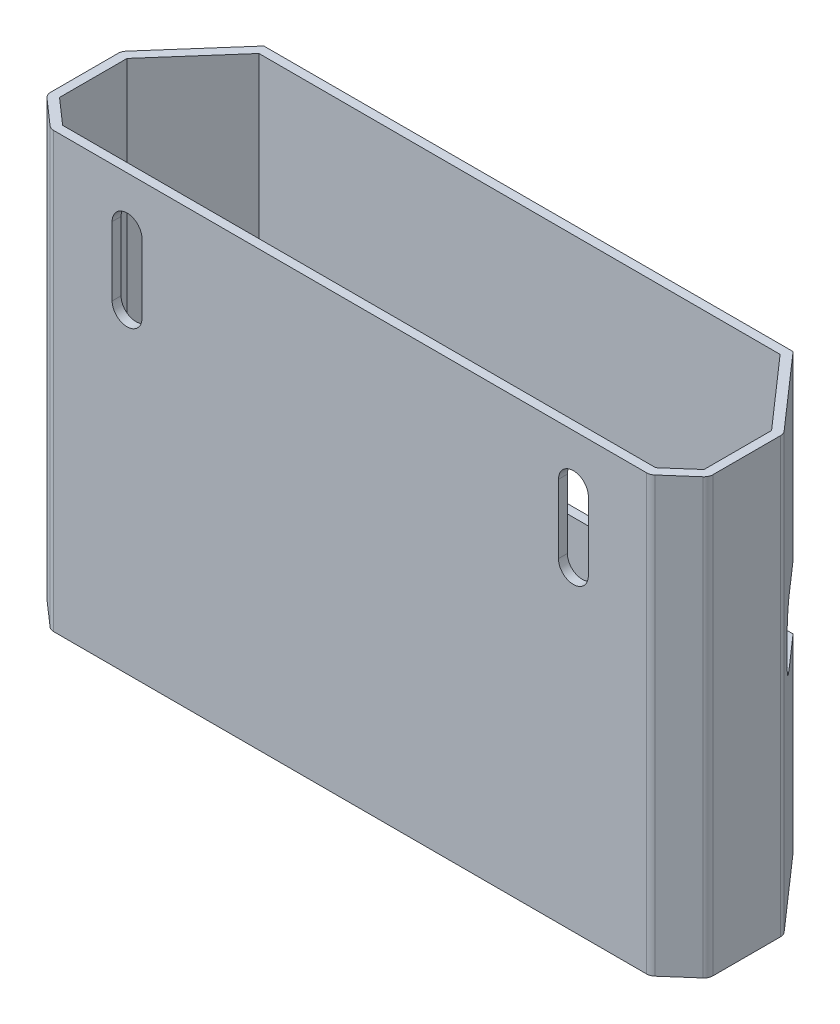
ISO-10303-21;
HEADER;
FILE_DESCRIPTION(('STEP AP214'),'2;1');
FILE_NAME('part.step','',(''),(''),'','','');
FILE_SCHEMA(('AUTOMOTIVE_DESIGN { 1 0 10303 214 1 1 1 1 }'));
ENDSEC;
DATA;
#1=APPLICATION_CONTEXT('core data for automotive mechanical design processes');
#2=APPLICATION_PROTOCOL_DEFINITION('international standard','automotive_design',2000,#1);
#3=PRODUCT_CONTEXT('',#1,'mechanical');
#4=PRODUCT('Part','Part','',(#3));
#5=PRODUCT_RELATED_PRODUCT_CATEGORY('part','',(#4));
#6=PRODUCT_DEFINITION_FORMATION('','',#4);
#7=PRODUCT_DEFINITION_CONTEXT('part definition',#1,'design');
#8=PRODUCT_DEFINITION('design','',#6,#7);
#9=PRODUCT_DEFINITION_SHAPE('','',#8);
#10=(LENGTH_UNIT() NAMED_UNIT(*) SI_UNIT(.MILLI.,.METRE.));
#11=(NAMED_UNIT(*) PLANE_ANGLE_UNIT() SI_UNIT($,.RADIAN.));
#12=(NAMED_UNIT(*) SI_UNIT($,.STERADIAN.) SOLID_ANGLE_UNIT());
#13=UNCERTAINTY_MEASURE_WITH_UNIT(LENGTH_MEASURE(1.E-05),#10,'distance_accuracy_value','');
#14=(GEOMETRIC_REPRESENTATION_CONTEXT(3) GLOBAL_UNCERTAINTY_ASSIGNED_CONTEXT((#13)) GLOBAL_UNIT_ASSIGNED_CONTEXT((#10,
#11,#12)) REPRESENTATION_CONTEXT('',''));
#15=CARTESIAN_POINT('',(0.,0.,0.));
#16=DIRECTION('',(0.,0.,1.));
#17=DIRECTION('',(1.,0.,0.));
#18=AXIS2_PLACEMENT_3D('',#15,#16,#17);
#19=CARTESIAN_POINT('',(-1.43095393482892,17.1137401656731,1.15075969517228));
#20=DIRECTION('',(-1.,0.,0.));
#21=DIRECTION('',(0.,0.,1.));
#22=AXIS2_PLACEMENT_3D('',#19,#20,#21);
#23=PLANE('',#22);
#24=DIRECTION('',(0.,0.,1.));
#25=VECTOR('',#24,1.);
#26=CARTESIAN_POINT('',(-1.43095393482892,20.1137401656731,1.23255970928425));
#27=LINE('',#26,#25);
#28=CARTESIAN_POINT('',(-1.43095393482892,20.1137401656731,1.15075969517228));
#29=VERTEX_POINT('',#28);
#30=CARTESIAN_POINT('',(-1.43095393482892,20.1137401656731,1.31435972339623));
#31=VERTEX_POINT('',#30);
#32=EDGE_CURVE('P0_E112',#29,#31,#27,.T.);
#33=ORIENTED_EDGE('',*,*,#32,.F.);
#34=DIRECTION('',(0.,1.,0.));
#35=VECTOR('',#34,1.);
#36=CARTESIAN_POINT('',(-1.43095393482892,17.1137401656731,1.15075969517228));
#37=LINE('',#36,#35);
#38=CARTESIAN_POINT('',(-1.43095393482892,17.1137401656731,1.15075969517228));
#39=VERTEX_POINT('',#38);
#40=EDGE_CURVE('P0_E134',#39,#29,#37,.T.);
#41=ORIENTED_EDGE('',*,*,#40,.F.);
#42=DIRECTION('',(0.,0.,1.));
#43=VECTOR('',#42,1.);
#44=CARTESIAN_POINT('',(-1.43095393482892,17.1137401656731,1.15075969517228));
#45=LINE('',#44,#43);
#46=CARTESIAN_POINT('',(-1.43095393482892,17.1137401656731,1.31435972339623));
#47=VERTEX_POINT('',#46);
#48=EDGE_CURVE('P0_E122',#39,#47,#45,.T.);
#49=ORIENTED_EDGE('',*,*,#48,.T.);
#50=DIRECTION('',(0.,1.,0.));
#51=VECTOR('',#50,1.);
#52=CARTESIAN_POINT('',(-1.43095393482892,17.1137401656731,1.31435972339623));
#53=LINE('',#52,#51);
#54=EDGE_CURVE('P0_E129',#31,#47,#53,.F.);
#55=ORIENTED_EDGE('',*,*,#54,.F.);
#56=EDGE_LOOP('',(#33,#41,#49,#55));
#57=FACE_BOUND('',#56,.T.);
#58=ADVANCED_FACE('P0_F16',(#57),#23,.T.);
#59=CARTESIAN_POINT('',(-0.284636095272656,20.1137401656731,1.23255970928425));
#60=DIRECTION('',(0.,1.,0.));
#61=DIRECTION('',(0.,0.,1.));
#62=AXIS2_PLACEMENT_3D('',#59,#60,#61);
#63=PLANE('',#62);
#64=DIRECTION('',(1.,0.,0.));
#65=VECTOR('',#64,1.);
#66=CARTESIAN_POINT('',(-1.43095393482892,20.1137401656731,1.31435972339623));
#67=LINE('',#66,#65);
#68=CARTESIAN_POINT('',(0.861681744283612,20.1137401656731,1.31435972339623));
#69=VERTEX_POINT('',#68);
#70=EDGE_CURVE('P0_E116',#69,#31,#67,.F.);
#71=ORIENTED_EDGE('',*,*,#70,.F.);
#72=DIRECTION('',(0.,0.,-1.));
#73=VECTOR('',#72,1.);
#74=CARTESIAN_POINT('',(0.861681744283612,20.1137401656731,1.31435972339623));
#75=LINE('',#74,#73);
#76=CARTESIAN_POINT('',(0.861681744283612,20.1137401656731,1.15075969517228));
#77=VERTEX_POINT('',#76);
#78=EDGE_CURVE('P0_E141',#77,#69,#75,.F.);
#79=ORIENTED_EDGE('',*,*,#78,.F.);
#80=DIRECTION('',(-1.,0.,0.));
#81=VECTOR('',#80,1.);
#82=CARTESIAN_POINT('',(0.861681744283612,20.1137401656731,1.15075969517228));
#83=LINE('',#82,#81);
#84=EDGE_CURVE('P0_E117',#29,#77,#83,.F.);
#85=ORIENTED_EDGE('',*,*,#84,.F.);
#86=ORIENTED_EDGE('',*,*,#32,.T.);
#87=EDGE_LOOP('',(#71,#79,#85,#86));
#88=FACE_BOUND('',#87,.T.);
#89=ADVANCED_FACE('P0_F114',(#88),#63,.T.);
#90=CARTESIAN_POINT('',(0.861681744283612,17.1137401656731,1.31435972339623));
#91=DIRECTION('',(1.,0.,0.));
#92=DIRECTION('',(0.,0.,-1.));
#93=AXIS2_PLACEMENT_3D('',#90,#91,#92);
#94=PLANE('',#93);
#95=ORIENTED_EDGE('',*,*,#78,.T.);
#96=DIRECTION('',(0.,1.,0.));
#97=VECTOR('',#96,1.);
#98=CARTESIAN_POINT('',(0.861681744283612,17.1137401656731,1.31435972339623));
#99=LINE('',#98,#97);
#100=CARTESIAN_POINT('',(0.861681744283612,17.1137401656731,1.31435972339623));
#101=VERTEX_POINT('',#100);
#102=EDGE_CURVE('P0_E132',#101,#69,#99,.T.);
#103=ORIENTED_EDGE('',*,*,#102,.F.);
#104=DIRECTION('',(0.,0.,-1.));
#105=VECTOR('',#104,1.);
#106=CARTESIAN_POINT('',(0.861681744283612,17.1137401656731,1.31435972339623));
#107=LINE('',#106,#105);
#108=CARTESIAN_POINT('',(0.861681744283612,17.1137401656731,1.15075969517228));
#109=VERTEX_POINT('',#108);
#110=EDGE_CURVE('P0_E121',#101,#109,#107,.T.);
#111=ORIENTED_EDGE('',*,*,#110,.T.);
#112=DIRECTION('',(0.,1.,0.));
#113=VECTOR('',#112,1.);
#114=CARTESIAN_POINT('',(0.861681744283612,17.1137401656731,1.15075969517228));
#115=LINE('',#114,#113);
#116=EDGE_CURVE('P0_E142',#77,#109,#115,.F.);
#117=ORIENTED_EDGE('',*,*,#116,.F.);
#118=EDGE_LOOP('',(#95,#103,#111,#117));
#119=FACE_BOUND('',#118,.T.);
#120=ADVANCED_FACE('P0_F308',(#119),#94,.T.);
#121=CARTESIAN_POINT('',(-1.43095393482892,17.1137401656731,1.31435972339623));
#122=DIRECTION('',(0.,0.,1.));
#123=DIRECTION('',(1.,0.,0.));
#124=AXIS2_PLACEMENT_3D('',#121,#122,#123);
#125=PLANE('',#124);
#126=ORIENTED_EDGE('',*,*,#70,.T.);
#127=ORIENTED_EDGE('',*,*,#54,.T.);
#128=DIRECTION('',(1.,0.,0.));
#129=VECTOR('',#128,1.);
#130=CARTESIAN_POINT('',(-0.285028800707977,17.1137401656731,1.31435972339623));
#131=LINE('',#130,#129);
#132=EDGE_CURVE('P0_E145',#101,#47,#131,.F.);
#133=ORIENTED_EDGE('',*,*,#132,.F.);
#134=ORIENTED_EDGE('',*,*,#102,.T.);
#135=EDGE_LOOP('',(#126,#127,#133,#134));
#136=FACE_BOUND('',#135,.T.);
#137=ADVANCED_FACE('P0_F127',(#136),#125,.T.);
#138=CARTESIAN_POINT('',(0.861681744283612,17.1137401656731,1.15075969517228));
#139=DIRECTION('',(0.,0.,-1.));
#140=DIRECTION('',(-1.,0.,0.));
#141=AXIS2_PLACEMENT_3D('',#138,#139,#140);
#142=PLANE('',#141);
#143=ORIENTED_EDGE('',*,*,#84,.T.);
#144=ORIENTED_EDGE('',*,*,#116,.T.);
#145=DIRECTION('',(1.,0.,0.));
#146=VECTOR('',#145,1.);
#147=CARTESIAN_POINT('',(-0.285028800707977,17.1137401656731,1.15075969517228));
#148=LINE('',#147,#146);
#149=EDGE_CURVE('P0_E147',#39,#109,#148,.T.);
#150=ORIENTED_EDGE('',*,*,#149,.F.);
#151=ORIENTED_EDGE('',*,*,#40,.T.);
#152=EDGE_LOOP('',(#143,#144,#150,#151));
#153=FACE_BOUND('',#152,.T.);
#154=ADVANCED_FACE('P0_F231',(#153),#142,.T.);
#155=CARTESIAN_POINT('',(-0.285028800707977,17.1137401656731,1.03930469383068));
#156=DIRECTION('',(0.,1.,0.));
#157=DIRECTION('',(0.,0.,1.));
#158=AXIS2_PLACEMENT_3D('',#155,#156,#157);
#159=PLANE('',#158);
#160=ORIENTED_EDGE('',*,*,#48,.F.);
#161=ORIENTED_EDGE('',*,*,#149,.T.);
#162=ORIENTED_EDGE('',*,*,#110,.F.);
#163=ORIENTED_EDGE('',*,*,#132,.T.);
#164=EDGE_LOOP('',(#160,#161,#162,#163));
#165=FACE_BOUND('',#164,.T.);
#166=DIRECTION('',(0.,0.,1.));
#167=VECTOR('',#166,1.);
#168=CARTESIAN_POINT('',(-3.90219203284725,17.1137401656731,0.887219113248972));
#169=LINE('',#168,#167);
#170=CARTESIAN_POINT('',(-3.90219203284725,17.1137401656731,1.64522548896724));
#171=VERTEX_POINT('',#170);
#172=CARTESIAN_POINT('',(-3.90219203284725,17.1137401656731,0.887219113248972));
#173=VERTEX_POINT('',#172);
#174=EDGE_CURVE('P0_E168',#171,#173,#169,.F.);
#175=ORIENTED_EDGE('',*,*,#174,.F.);
#176=DIRECTION('',(0.751389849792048,0.,0.659858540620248));
#177=VECTOR('',#176,1.);
#178=CARTESIAN_POINT('',(-3.90219203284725,17.1137401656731,1.64522548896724));
#179=LINE('',#178,#177);
#180=CARTESIAN_POINT('',(-3.61207684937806,17.1137401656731,1.9));
#181=VERTEX_POINT('',#180);
#182=EDGE_CURVE('P0_E172',#181,#171,#179,.F.);
#183=ORIENTED_EDGE('',*,*,#182,.F.);
#184=DIRECTION('',(1.,0.,0.));
#185=VECTOR('',#184,1.);
#186=CARTESIAN_POINT('',(-3.61207684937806,17.1137401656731,1.9));
#187=LINE('',#186,#185);
#188=CARTESIAN_POINT('',(3.04280465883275,17.1137401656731,1.9));
#189=VERTEX_POINT('',#188);
#190=EDGE_CURVE('P0_E63',#189,#181,#187,.F.);
#191=ORIENTED_EDGE('',*,*,#190,.F.);
#192=DIRECTION('',(0.751389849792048,0.,-0.659858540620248));
#193=VECTOR('',#192,1.);
#194=CARTESIAN_POINT('',(3.04280465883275,17.1137401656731,1.9));
#195=LINE('',#194,#193);
#196=CARTESIAN_POINT('',(3.33183248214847,17.1137401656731,1.64618039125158));
#197=VERTEX_POINT('',#196);
#198=EDGE_CURVE('P0_E150',#197,#189,#195,.F.);
#199=ORIENTED_EDGE('',*,*,#198,.F.);
#200=DIRECTION('',(0.,0.,-1.));
#201=VECTOR('',#200,1.);
#202=CARTESIAN_POINT('',(3.33183248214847,17.1137401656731,1.64618039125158));
#203=LINE('',#202,#201);
#204=CARTESIAN_POINT('',(3.33183248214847,17.1137401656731,0.888174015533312));
#205=VERTEX_POINT('',#204);
#206=EDGE_CURVE('P0_E153',#205,#197,#203,.F.);
#207=ORIENTED_EDGE('',*,*,#206,.F.);
#208=DIRECTION('',(-0.659858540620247,0.,-0.751389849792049));
#209=VECTOR('',#208,1.);
#210=CARTESIAN_POINT('',(3.33183248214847,17.1137401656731,0.888174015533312));
#211=LINE('',#210,#209);
#212=CARTESIAN_POINT('',(2.63967067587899,17.1137401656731,0.0999999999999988));
#213=VERTEX_POINT('',#212);
#214=EDGE_CURVE('P0_E156',#213,#205,#211,.F.);
#215=ORIENTED_EDGE('',*,*,#214,.F.);
#216=DIRECTION('',(-1.,0.,0.));
#217=VECTOR('',#216,1.);
#218=CARTESIAN_POINT('',(2.63967067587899,17.1137401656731,0.1));
#219=LINE('',#218,#217);
#220=CARTESIAN_POINT('',(-3.20894286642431,17.1137401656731,0.1));
#221=VERTEX_POINT('',#220);
#222=EDGE_CURVE('P0_E160',#221,#213,#219,.F.);
#223=ORIENTED_EDGE('',*,*,#222,.F.);
#224=DIRECTION('',(-0.660894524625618,0.,0.750478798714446));
#225=VECTOR('',#224,1.);
#226=CARTESIAN_POINT('',(-3.20894286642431,17.1137401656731,0.1));
#227=LINE('',#226,#225);
#228=EDGE_CURVE('P0_E164',#173,#221,#227,.F.);
#229=ORIENTED_EDGE('',*,*,#228,.F.);
#230=EDGE_LOOP('',(#175,#183,#191,#199,#207,#215,#223,#229));
#231=FACE_BOUND('',#230,.T.);
#232=ADVANCED_FACE('P0_F229',(#165,#231),#159,.T.);
#233=CARTESIAN_POINT('',(3.04280465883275,16.1137401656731,1.9));
#234=DIRECTION('',(0.659858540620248,0.,0.751389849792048));
#235=DIRECTION('',(0.751389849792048,0.,-0.659858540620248));
#236=AXIS2_PLACEMENT_3D('',#233,#234,#235);
#237=PLANE('',#236);
#238=ORIENTED_EDGE('',*,*,#198,.T.);
#239=DIRECTION('',(0.,1.,0.));
#240=VECTOR('',#239,1.);
#241=CARTESIAN_POINT('',(3.04280465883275,16.1137401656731,1.9));
#242=LINE('',#241,#240);
#243=CARTESIAN_POINT('',(3.04280465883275,16.1137401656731,1.9));
#244=VERTEX_POINT('',#243);
#245=EDGE_CURVE('P0_E176',#244,#189,#242,.T.);
#246=ORIENTED_EDGE('',*,*,#245,.F.);
#247=DIRECTION('',(0.751389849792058,0.,-0.659858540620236));
#248=VECTOR('',#247,1.);
#249=CARTESIAN_POINT('',(3.04280465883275,16.1137401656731,1.9));
#250=LINE('',#249,#248);
#251=CARTESIAN_POINT('',(3.33183248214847,16.1137401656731,1.64618039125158));
#252=VERTEX_POINT('',#251);
#253=EDGE_CURVE('P0_E20',#244,#252,#250,.T.);
#254=ORIENTED_EDGE('',*,*,#253,.T.);
#255=DIRECTION('',(0.,1.,0.));
#256=VECTOR('',#255,1.);
#257=CARTESIAN_POINT('',(3.33183248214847,16.1137401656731,1.64618039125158));
#258=LINE('',#257,#256);
#259=EDGE_CURVE('P0_E154',#197,#252,#258,.F.);
#260=ORIENTED_EDGE('',*,*,#259,.F.);
#261=EDGE_LOOP('',(#238,#246,#254,#260));
#262=FACE_BOUND('',#261,.T.);
#263=ADVANCED_FACE('P0_F200',(#262),#237,.T.);
#264=CARTESIAN_POINT('',(3.33183248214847,16.1137401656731,1.64618039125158));
#265=DIRECTION('',(1.,0.,0.));
#266=DIRECTION('',(0.,0.,-1.));
#267=AXIS2_PLACEMENT_3D('',#264,#265,#266);
#268=PLANE('',#267);
#269=ORIENTED_EDGE('',*,*,#206,.T.);
#270=ORIENTED_EDGE('',*,*,#259,.T.);
#271=DIRECTION('',(0.,0.,1.));
#272=VECTOR('',#271,1.);
#273=CARTESIAN_POINT('',(3.33183248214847,16.1137401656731,1.03930469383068));
#274=LINE('',#273,#272);
#275=CARTESIAN_POINT('',(3.33183248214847,16.1137401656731,0.888174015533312));
#276=VERTEX_POINT('',#275);
#277=EDGE_CURVE('P0_E194',#252,#276,#274,.F.);
#278=ORIENTED_EDGE('',*,*,#277,.T.);
#279=DIRECTION('',(0.,1.,0.));
#280=VECTOR('',#279,1.);
#281=CARTESIAN_POINT('',(3.33183248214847,16.1137401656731,0.888174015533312));
#282=LINE('',#281,#280);
#283=EDGE_CURVE('P0_E158',#205,#276,#282,.F.);
#284=ORIENTED_EDGE('',*,*,#283,.F.);
#285=EDGE_LOOP('',(#269,#270,#278,#284));
#286=FACE_BOUND('',#285,.T.);
#287=ADVANCED_FACE('P0_F227',(#286),#268,.T.);
#288=CARTESIAN_POINT('',(3.33183248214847,16.1137401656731,0.888174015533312));
#289=DIRECTION('',(0.751389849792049,0.,-0.659858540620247));
#290=DIRECTION('',(-0.659858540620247,0.,-0.751389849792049));
#291=AXIS2_PLACEMENT_3D('',#288,#289,#290);
#292=PLANE('',#291);
#293=ORIENTED_EDGE('',*,*,#214,.T.);
#294=ORIENTED_EDGE('',*,*,#283,.T.);
#295=DIRECTION('',(-0.659858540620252,0.,-0.751389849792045));
#296=VECTOR('',#295,1.);
#297=CARTESIAN_POINT('',(3.33183248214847,16.1137401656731,0.888174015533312));
#298=LINE('',#297,#296);
#299=CARTESIAN_POINT('',(2.63967067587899,16.1137401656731,0.0999999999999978));
#300=VERTEX_POINT('',#299);
#301=EDGE_CURVE('P0_E192',#276,#300,#298,.T.);
#302=ORIENTED_EDGE('',*,*,#301,.T.);
#303=DIRECTION('',(0.,1.,0.));
#304=VECTOR('',#303,1.);
#305=CARTESIAN_POINT('',(2.63967067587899,16.1137401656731,0.1));
#306=LINE('',#305,#304);
#307=EDGE_CURVE('P0_E162',#213,#300,#306,.F.);
#308=ORIENTED_EDGE('',*,*,#307,.F.);
#309=EDGE_LOOP('',(#293,#294,#302,#308));
#310=FACE_BOUND('',#309,.T.);
#311=ADVANCED_FACE('P0_F225',(#310),#292,.T.);
#312=CARTESIAN_POINT('',(2.63967067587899,16.1137401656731,0.1));
#313=DIRECTION('',(0.,0.,-1.));
#314=DIRECTION('',(-1.,0.,0.));
#315=AXIS2_PLACEMENT_3D('',#312,#313,#314);
#316=PLANE('',#315);
#317=ORIENTED_EDGE('',*,*,#222,.T.);
#318=ORIENTED_EDGE('',*,*,#307,.T.);
#319=DIRECTION('',(1.,0.,0.));
#320=VECTOR('',#319,1.);
#321=CARTESIAN_POINT('',(-0.285028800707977,16.1137401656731,0.1));
#322=LINE('',#321,#320);
#323=CARTESIAN_POINT('',(-3.20894286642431,16.1137401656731,0.1));
#324=VERTEX_POINT('',#323);
#325=EDGE_CURVE('P0_E189',#300,#324,#322,.F.);
#326=ORIENTED_EDGE('',*,*,#325,.T.);
#327=DIRECTION('',(0.,1.,0.));
#328=VECTOR('',#327,1.);
#329=CARTESIAN_POINT('',(-3.20894286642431,16.1137401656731,0.1));
#330=LINE('',#329,#328);
#331=EDGE_CURVE('P0_E166',#221,#324,#330,.F.);
#332=ORIENTED_EDGE('',*,*,#331,.F.);
#333=EDGE_LOOP('',(#317,#318,#326,#332));
#334=FACE_BOUND('',#333,.T.);
#335=ADVANCED_FACE('P0_F220',(#334),#316,.T.);
#336=CARTESIAN_POINT('',(-3.20894286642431,16.1137401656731,0.1));
#337=DIRECTION('',(-0.750478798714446,0.,-0.660894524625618));
#338=DIRECTION('',(-0.660894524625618,0.,0.750478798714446));
#339=AXIS2_PLACEMENT_3D('',#336,#337,#338);
#340=PLANE('',#339);
#341=ORIENTED_EDGE('',*,*,#228,.T.);
#342=ORIENTED_EDGE('',*,*,#331,.T.);
#343=DIRECTION('',(-0.660894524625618,0.,0.750478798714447));
#344=VECTOR('',#343,1.);
#345=CARTESIAN_POINT('',(-3.20894286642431,16.1137401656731,0.1));
#346=LINE('',#345,#344);
#347=CARTESIAN_POINT('',(-3.90219203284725,16.1137401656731,0.887219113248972));
#348=VERTEX_POINT('',#347);
#349=EDGE_CURVE('P0_E186',#324,#348,#346,.T.);
#350=ORIENTED_EDGE('',*,*,#349,.T.);
#351=DIRECTION('',(0.,1.,0.));
#352=VECTOR('',#351,1.);
#353=CARTESIAN_POINT('',(-3.90219203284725,16.1137401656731,0.887219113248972));
#354=LINE('',#353,#352);
#355=EDGE_CURVE('P0_E170',#173,#348,#354,.F.);
#356=ORIENTED_EDGE('',*,*,#355,.F.);
#357=EDGE_LOOP('',(#341,#342,#350,#356));
#358=FACE_BOUND('',#357,.T.);
#359=ADVANCED_FACE('P0_F216',(#358),#340,.T.);
#360=CARTESIAN_POINT('',(-3.90219203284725,16.1137401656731,0.887219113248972));
#361=DIRECTION('',(-1.,0.,0.));
#362=DIRECTION('',(0.,0.,1.));
#363=AXIS2_PLACEMENT_3D('',#360,#361,#362);
#364=PLANE('',#363);
#365=ORIENTED_EDGE('',*,*,#174,.T.);
#366=ORIENTED_EDGE('',*,*,#355,.T.);
#367=DIRECTION('',(0.,0.,1.));
#368=VECTOR('',#367,1.);
#369=CARTESIAN_POINT('',(-3.90219203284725,16.1137401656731,1.03930469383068));
#370=LINE('',#369,#368);
#371=CARTESIAN_POINT('',(-3.90219203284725,16.1137401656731,1.64522548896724));
#372=VERTEX_POINT('',#371);
#373=EDGE_CURVE('P0_E183',#348,#372,#370,.T.);
#374=ORIENTED_EDGE('',*,*,#373,.T.);
#375=DIRECTION('',(0.,1.,0.));
#376=VECTOR('',#375,1.);
#377=CARTESIAN_POINT('',(-3.90219203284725,16.1137401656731,1.64522548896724));
#378=LINE('',#377,#376);
#379=EDGE_CURVE('P0_E174',#171,#372,#378,.F.);
#380=ORIENTED_EDGE('',*,*,#379,.F.);
#381=EDGE_LOOP('',(#365,#366,#374,#380));
#382=FACE_BOUND('',#381,.T.);
#383=ADVANCED_FACE('P0_F210',(#382),#364,.T.);
#384=CARTESIAN_POINT('',(-3.90219203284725,16.1137401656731,1.64522548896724));
#385=DIRECTION('',(-0.659858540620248,0.,0.751389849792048));
#386=DIRECTION('',(0.751389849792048,0.,0.659858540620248));
#387=AXIS2_PLACEMENT_3D('',#384,#385,#386);
#388=PLANE('',#387);
#389=ORIENTED_EDGE('',*,*,#182,.T.);
#390=ORIENTED_EDGE('',*,*,#379,.T.);
#391=DIRECTION('',(0.75138984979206,0.,0.659858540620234));
#392=VECTOR('',#391,1.);
#393=CARTESIAN_POINT('',(-3.90219203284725,16.1137401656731,1.64522548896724));
#394=LINE('',#393,#392);
#395=CARTESIAN_POINT('',(-3.61207684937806,16.1137401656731,1.9));
#396=VERTEX_POINT('',#395);
#397=EDGE_CURVE('P0_E26',#372,#396,#394,.T.);
#398=ORIENTED_EDGE('',*,*,#397,.T.);
#399=DIRECTION('',(0.,1.,0.));
#400=VECTOR('',#399,1.);
#401=CARTESIAN_POINT('',(-3.61207684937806,16.1137401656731,1.9));
#402=LINE('',#401,#400);
#403=EDGE_CURVE('P0_E34',#181,#396,#402,.F.);
#404=ORIENTED_EDGE('',*,*,#403,.F.);
#405=EDGE_LOOP('',(#389,#390,#398,#404));
#406=FACE_BOUND('',#405,.T.);
#407=ADVANCED_FACE('P0_F206',(#406),#388,.T.);
#408=CARTESIAN_POINT('',(-3.61207684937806,16.1137401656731,1.9));
#409=DIRECTION('',(0.,0.,1.));
#410=DIRECTION('',(1.,0.,0.));
#411=AXIS2_PLACEMENT_3D('',#408,#409,#410);
#412=PLANE('',#411);
#413=ORIENTED_EDGE('',*,*,#190,.T.);
#414=ORIENTED_EDGE('',*,*,#403,.T.);
#415=DIRECTION('',(1.,0.,0.));
#416=VECTOR('',#415,1.);
#417=CARTESIAN_POINT('',(-0.285028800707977,16.1137401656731,1.9));
#418=LINE('',#417,#416);
#419=EDGE_CURVE('P0_E11',#396,#244,#418,.T.);
#420=ORIENTED_EDGE('',*,*,#419,.T.);
#421=ORIENTED_EDGE('',*,*,#245,.T.);
#422=EDGE_LOOP('',(#413,#414,#420,#421));
#423=FACE_BOUND('',#422,.T.);
#424=ADVANCED_FACE('P0_F202',(#423),#412,.T.);
#425=CARTESIAN_POINT('',(-0.285028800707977,16.1137401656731,1.03930469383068));
#426=DIRECTION('',(0.,1.,0.));
#427=DIRECTION('',(0.,0.,1.));
#428=AXIS2_PLACEMENT_3D('',#425,#426,#427);
#429=PLANE('',#428);
#430=ORIENTED_EDGE('',*,*,#397,.F.);
#431=ORIENTED_EDGE('',*,*,#373,.F.);
#432=ORIENTED_EDGE('',*,*,#349,.F.);
#433=ORIENTED_EDGE('',*,*,#325,.F.);
#434=ORIENTED_EDGE('',*,*,#301,.F.);
#435=ORIENTED_EDGE('',*,*,#277,.F.);
#436=ORIENTED_EDGE('',*,*,#253,.F.);
#437=ORIENTED_EDGE('',*,*,#419,.F.);
#438=EDGE_LOOP('',(#430,#431,#432,#433,#434,#435,#436,#437));
#439=FACE_BOUND('',#438,.T.);
#440=ADVANCED_FACE('P0_F18',(#439),#429,.F.);
#441=CLOSED_SHELL('',(#58,#89,#120,#137,#154,#232,#263,#287,#311,#335,#359,#383,#407,#424,#440));
#442=MANIFOLD_SOLID_BREP('P0_B1',#441);
#443=CARTESIAN_POINT('',(-4.00110467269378,20.8850434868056,0.));
#444=DIRECTION('',(-1.,0.,0.));
#445=DIRECTION('',(0.,0.,1.));
#446=AXIS2_PLACEMENT_3D('',#443,#444,#445);
#447=PLANE('',#446);
#448=DIRECTION('',(0.,1.,0.));
#449=VECTOR('',#448,1.);
#450=CARTESIAN_POINT('',(-4.00110467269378,20.8850434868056,1.64618039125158));
#451=LINE('',#450,#449);
#452=CARTESIAN_POINT('',(-4.00110467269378,20.8850434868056,1.64618039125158));
#453=VERTEX_POINT('',#452);
#454=CARTESIAN_POINT('',(-4.00110467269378,16.0137401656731,1.64618039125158));
#455=VERTEX_POINT('',#454);
#456=EDGE_CURVE('P1_E264',#453,#455,#451,.F.);
#457=ORIENTED_EDGE('',*,*,#456,.F.);
#458=DIRECTION('',(0.,0.,1.));
#459=VECTOR('',#458,1.);
#460=CARTESIAN_POINT('',(-4.00110467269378,20.8850434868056,0.));
#461=LINE('',#460,#459);
#462=CARTESIAN_POINT('',(-4.00110467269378,20.8850434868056,0.888174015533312));
#463=VERTEX_POINT('',#462);
#464=EDGE_CURVE('P1_E262',#453,#463,#461,.F.);
#465=ORIENTED_EDGE('',*,*,#464,.T.);
#466=DIRECTION('',(0.,-1.,0.));
#467=VECTOR('',#466,1.);
#468=CARTESIAN_POINT('',(-4.00110467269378,20.8850434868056,0.888174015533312));
#469=LINE('',#468,#467);
#470=CARTESIAN_POINT('',(-4.00110467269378,16.0137401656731,0.888174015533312));
#471=VERTEX_POINT('',#470);
#472=EDGE_CURVE('P1_E272',#471,#463,#469,.F.);
#473=ORIENTED_EDGE('',*,*,#472,.F.);
#474=DIRECTION('',(0.,0.,1.));
#475=VECTOR('',#474,1.);
#476=CARTESIAN_POINT('',(-4.00110467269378,16.0137401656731,0.));
#477=LINE('',#476,#475);
#478=EDGE_CURVE('P1_E269',#471,#455,#477,.T.);
#479=ORIENTED_EDGE('',*,*,#478,.T.);
#480=EDGE_LOOP('',(#457,#465,#473,#479));
#481=FACE_BOUND('',#480,.T.);
#482=ADVANCED_FACE('P1_F15',(#481),#447,.T.);
#483=CARTESIAN_POINT('',(3.43183248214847,16.0137401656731,0.));
#484=DIRECTION('',(1.,0.,0.));
#485=DIRECTION('',(0.,0.,-1.));
#486=AXIS2_PLACEMENT_3D('',#483,#484,#485);
#487=PLANE('',#486);
#488=DIRECTION('',(0.,-1.,0.));
#489=VECTOR('',#488,1.);
#490=CARTESIAN_POINT('',(3.43183248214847,18.4493918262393,1.64618039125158));
#491=LINE('',#490,#489);
#492=CARTESIAN_POINT('',(3.43183248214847,16.0137401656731,1.64618039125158));
#493=VERTEX_POINT('',#492);
#494=CARTESIAN_POINT('',(3.43183248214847,20.8850434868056,1.64618039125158));
#495=VERTEX_POINT('',#494);
#496=EDGE_CURVE('P1_E250',#493,#495,#491,.F.);
#497=ORIENTED_EDGE('',*,*,#496,.F.);
#498=DIRECTION('',(0.,0.,-1.));
#499=VECTOR('',#498,1.);
#500=CARTESIAN_POINT('',(3.43183248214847,16.0137401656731,0.));
#501=LINE('',#500,#499);
#502=CARTESIAN_POINT('',(3.43183248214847,16.0137401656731,0.888174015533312));
#503=VERTEX_POINT('',#502);
#504=EDGE_CURVE('P1_E227',#493,#503,#501,.T.);
#505=ORIENTED_EDGE('',*,*,#504,.T.);
#506=DIRECTION('',(0.,1.,0.));
#507=VECTOR('',#506,1.);
#508=CARTESIAN_POINT('',(3.43183248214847,18.4493918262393,0.888174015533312));
#509=LINE('',#508,#507);
#510=CARTESIAN_POINT('',(3.43183248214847,20.8850434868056,0.888174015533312));
#511=VERTEX_POINT('',#510);
#512=EDGE_CURVE('P1_E226',#511,#503,#509,.F.);
#513=ORIENTED_EDGE('',*,*,#512,.F.);
#514=DIRECTION('',(0.,0.,-1.));
#515=VECTOR('',#514,1.);
#516=CARTESIAN_POINT('',(3.43183248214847,20.8850434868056,0.));
#517=LINE('',#516,#515);
#518=EDGE_CURVE('P1_E222',#511,#495,#517,.F.);
#519=ORIENTED_EDGE('',*,*,#518,.T.);
#520=EDGE_LOOP('',(#497,#505,#513,#519));
#521=FACE_BOUND('',#520,.T.);
#522=ADVANCED_FACE('P1_F798',(#521),#487,.T.);
#523=CARTESIAN_POINT('',(3.33183248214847,18.4493918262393,0.888174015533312));
#524=DIRECTION('',(0.,1.,0.));
#525=DIRECTION('',(0.,0.,1.));
#526=AXIS2_PLACEMENT_3D('',#523,#524,#525);
#527=CYLINDRICAL_SURFACE('',#526,0.1);
#528=CARTESIAN_POINT('',(3.33183248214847,16.0137401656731,0.888174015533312));
#529=DIRECTION('',(0.,1.,0.));
#530=DIRECTION('',(0.,0.,1.));
#531=AXIS2_PLACEMENT_3D('',#528,#529,#530);
#532=CIRCLE('',#531,0.1);
#533=CARTESIAN_POINT('',(3.40697146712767,16.0137401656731,0.822188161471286));
#534=VERTEX_POINT('',#533);
#535=EDGE_CURVE('P1_E233',#503,#534,#532,.T.);
#536=ORIENTED_EDGE('',*,*,#535,.T.);
#537=DIRECTION('',(0.,1.,0.));
#538=VECTOR('',#537,1.);
#539=CARTESIAN_POINT('',(3.40697146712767,20.8850434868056,0.822188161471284));
#540=LINE('',#539,#538);
#541=CARTESIAN_POINT('',(3.40697146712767,20.8850434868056,0.822188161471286));
#542=VERTEX_POINT('',#541);
#543=EDGE_CURVE('P1_E230',#534,#542,#540,.T.);
#544=ORIENTED_EDGE('',*,*,#543,.T.);
#545=CARTESIAN_POINT('',(3.33183248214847,20.8850434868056,0.888174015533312));
#546=DIRECTION('',(0.,1.,0.));
#547=DIRECTION('',(0.,0.,1.));
#548=AXIS2_PLACEMENT_3D('',#545,#546,#547);
#549=CIRCLE('',#548,0.1);
#550=EDGE_CURVE('P1_E19',#542,#511,#549,.F.);
#551=ORIENTED_EDGE('',*,*,#550,.T.);
#552=ORIENTED_EDGE('',*,*,#512,.T.);
#553=EDGE_LOOP('',(#536,#544,#551,#552));
#554=FACE_BOUND('',#553,.T.);
#555=ADVANCED_FACE('P1_F231',(#554),#527,.T.);
#556=CARTESIAN_POINT('',(-3.90110467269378,20.8850434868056,0.888174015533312));
#557=DIRECTION('',(0.,-1.,0.));
#558=DIRECTION('',(0.,0.,-1.));
#559=AXIS2_PLACEMENT_3D('',#556,#557,#558);
#560=CYLINDRICAL_SURFACE('',#559,0.1);
#561=CARTESIAN_POINT('',(-3.90110467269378,20.8850434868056,0.888174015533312));
#562=DIRECTION('',(0.,-1.,0.));
#563=DIRECTION('',(0.,0.,-1.));
#564=AXIS2_PLACEMENT_3D('',#561,#562,#563);
#565=CIRCLE('',#564,0.1);
#566=CARTESIAN_POINT('',(-3.97624365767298,20.8850434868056,0.822188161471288));
#567=VERTEX_POINT('',#566);
#568=EDGE_CURVE('P1_E275',#463,#567,#565,.T.);
#569=ORIENTED_EDGE('',*,*,#568,.T.);
#570=DIRECTION('',(0.,1.,0.));
#571=VECTOR('',#570,1.);
#572=CARTESIAN_POINT('',(-3.97624365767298,20.8850434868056,0.822188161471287));
#573=LINE('',#572,#571);
#574=CARTESIAN_POINT('',(-3.97624365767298,16.0137401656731,0.822188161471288));
#575=VERTEX_POINT('',#574);
#576=EDGE_CURVE('P1_E372',#567,#575,#573,.F.);
#577=ORIENTED_EDGE('',*,*,#576,.T.);
#578=CARTESIAN_POINT('',(-3.90110467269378,16.0137401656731,0.888174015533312));
#579=DIRECTION('',(0.,-1.,0.));
#580=DIRECTION('',(0.,0.,-1.));
#581=AXIS2_PLACEMENT_3D('',#578,#579,#580);
#582=CIRCLE('',#581,0.1);
#583=EDGE_CURVE('P1_E276',#575,#471,#582,.F.);
#584=ORIENTED_EDGE('',*,*,#583,.T.);
#585=ORIENTED_EDGE('',*,*,#472,.T.);
#586=EDGE_LOOP('',(#569,#577,#584,#585));
#587=FACE_BOUND('',#586,.T.);
#588=ADVANCED_FACE('P1_F369',(#587),#560,.T.);
#589=CARTESIAN_POINT('',(3.43183248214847,18.6684421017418,0.354210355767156));
#590=DIRECTION('',(-1.,0.,0.));
#591=DIRECTION('',(0.,0.,1.));
#592=AXIS2_PLACEMENT_3D('',#589,#590,#591);
#593=CYLINDRICAL_SURFACE('',#592,0.189249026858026);
#594=DIRECTION('',(1.,0.,0.));
#595=VECTOR('',#594,1.);
#596=CARTESIAN_POINT('',(3.43183248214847,18.8576911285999,0.354210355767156));
#597=LINE('',#596,#595);
#598=CARTESIAN_POINT('',(2.8629141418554,18.8576911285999,0.354210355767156));
#599=VERTEX_POINT('',#598);
#600=CARTESIAN_POINT('',(2.9960008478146,18.8576911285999,0.354210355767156));
#601=VERTEX_POINT('',#600);
#602=EDGE_CURVE('P1_E388',#599,#601,#597,.T.);
#603=ORIENTED_EDGE('',*,*,#602,.T.);
#604=CARTESIAN_POINT('',(2.9960008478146,18.6684421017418,0.354210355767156));
#605=DIRECTION('',(-0.751389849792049,0.,0.659858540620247));
#606=DIRECTION('',(-0.659858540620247,0.,-0.751389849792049));
#607=AXIS2_PLACEMENT_3D('',#604,#605,#606);
#608=ELLIPSE('',#607,0.251865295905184,0.189249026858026);
#609=CARTESIAN_POINT('',(3.16219631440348,18.6684421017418,0.543459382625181));
#610=VERTEX_POINT('',#609);
#611=EDGE_CURVE('P1_E244',#601,#610,#608,.F.);
#612=ORIENTED_EDGE('',*,*,#611,.T.);
#613=DIRECTION('',(1.,0.,0.));
#614=VECTOR('',#613,1.);
#615=CARTESIAN_POINT('',(3.43183248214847,18.6684421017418,0.543459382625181));
#616=LINE('',#615,#614);
#617=CARTESIAN_POINT('',(3.02910960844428,18.6684421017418,0.543459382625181));
#618=VERTEX_POINT('',#617);
#619=EDGE_CURVE('P1_E365',#610,#618,#616,.F.);
#620=ORIENTED_EDGE('',*,*,#619,.T.);
#621=CARTESIAN_POINT('',(2.8629141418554,18.6684421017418,0.354210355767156));
#622=DIRECTION('',(-0.751389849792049,0.,0.659858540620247));
#623=DIRECTION('',(-0.659858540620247,0.,-0.751389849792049));
#624=AXIS2_PLACEMENT_3D('',#621,#622,#623);
#625=ELLIPSE('',#624,0.251865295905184,0.189249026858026);
#626=EDGE_CURVE('P1_E340',#599,#618,#625,.F.);
#627=ORIENTED_EDGE('',*,*,#626,.F.);
#628=EDGE_LOOP('',(#603,#612,#620,#627));
#629=FACE_BOUND('',#628,.T.);
#630=ADVANCED_FACE('P1_F724',(#629),#593,.F.);
#631=CARTESIAN_POINT('',(3.43183248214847,18.3303415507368,0.543459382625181));
#632=DIRECTION('',(0.,0.,1.));
#633=DIRECTION('',(0.,-1.,0.));
#634=AXIS2_PLACEMENT_3D('',#631,#632,#633);
#635=PLANE('',#634);
#636=ORIENTED_EDGE('',*,*,#619,.F.);
#637=DIRECTION('',(0.,1.,0.));
#638=VECTOR('',#637,1.);
#639=CARTESIAN_POINT('',(3.16219631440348,20.8850434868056,0.543459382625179));
#640=LINE('',#639,#638);
#641=CARTESIAN_POINT('',(3.16219631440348,18.3303415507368,0.543459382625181));
#642=VERTEX_POINT('',#641);
#643=EDGE_CURVE('P1_E247',#610,#642,#640,.F.);
#644=ORIENTED_EDGE('',*,*,#643,.T.);
#645=DIRECTION('',(-1.,0.,0.));
#646=VECTOR('',#645,1.);
#647=CARTESIAN_POINT('',(3.43183248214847,18.3303415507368,0.543459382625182));
#648=LINE('',#647,#646);
#649=CARTESIAN_POINT('',(3.02910960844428,18.3303415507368,0.543459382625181));
#650=VERTEX_POINT('',#649);
#651=EDGE_CURVE('P1_E554',#642,#650,#648,.T.);
#652=ORIENTED_EDGE('',*,*,#651,.T.);
#653=DIRECTION('',(0.,1.,0.));
#654=VECTOR('',#653,1.);
#655=CARTESIAN_POINT('',(3.02910960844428,20.8850434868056,0.54345938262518));
#656=LINE('',#655,#654);
#657=EDGE_CURVE('P1_E339',#618,#650,#656,.F.);
#658=ORIENTED_EDGE('',*,*,#657,.F.);
#659=EDGE_LOOP('',(#636,#644,#652,#658));
#660=FACE_BOUND('',#659,.T.);
#661=ADVANCED_FACE('P1_F716',(#660),#635,.F.);
#662=CARTESIAN_POINT('',(3.43183248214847,18.3303415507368,0.354210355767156));
#663=DIRECTION('',(-1.,0.,0.));
#664=DIRECTION('',(0.,0.,1.));
#665=AXIS2_PLACEMENT_3D('',#662,#663,#664);
#666=CYLINDRICAL_SURFACE('',#665,0.189249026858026);
#667=ORIENTED_EDGE('',*,*,#651,.F.);
#668=CARTESIAN_POINT('',(2.9960008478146,18.3303415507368,0.354210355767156));
#669=DIRECTION('',(-0.751389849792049,0.,0.659858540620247));
#670=DIRECTION('',(-0.659858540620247,0.,-0.751389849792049));
#671=AXIS2_PLACEMENT_3D('',#668,#669,#670);
#672=ELLIPSE('',#671,0.251865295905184,0.189249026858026);
#673=CARTESIAN_POINT('',(2.9960008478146,18.1410925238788,0.354210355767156));
#674=VERTEX_POINT('',#673);
#675=EDGE_CURVE('P1_E351',#642,#674,#672,.F.);
#676=ORIENTED_EDGE('',*,*,#675,.T.);
#677=DIRECTION('',(1.,0.,0.));
#678=VECTOR('',#677,1.);
#679=CARTESIAN_POINT('',(3.43183248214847,18.1410925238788,0.354210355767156));
#680=LINE('',#679,#678);
#681=CARTESIAN_POINT('',(2.8629141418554,18.1410925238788,0.354210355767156));
#682=VERTEX_POINT('',#681);
#683=EDGE_CURVE('P1_E545',#674,#682,#680,.F.);
#684=ORIENTED_EDGE('',*,*,#683,.T.);
#685=CARTESIAN_POINT('',(2.8629141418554,18.3303415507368,0.354210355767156));
#686=DIRECTION('',(-0.751389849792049,0.,0.659858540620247));
#687=DIRECTION('',(-0.659858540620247,0.,-0.751389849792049));
#688=AXIS2_PLACEMENT_3D('',#685,#686,#687);
#689=ELLIPSE('',#688,0.251865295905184,0.189249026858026);
#690=EDGE_CURVE('P1_E336',#650,#682,#689,.F.);
#691=ORIENTED_EDGE('',*,*,#690,.F.);
#692=EDGE_LOOP('',(#667,#676,#684,#691));
#693=FACE_BOUND('',#692,.T.);
#694=ADVANCED_FACE('P1_F718',(#693),#666,.F.);
#695=CARTESIAN_POINT('',(3.43183248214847,18.3303415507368,0.354210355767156));
#696=DIRECTION('',(-1.,0.,0.));
#697=DIRECTION('',(0.,0.,1.));
#698=AXIS2_PLACEMENT_3D('',#695,#696,#697);
#699=CYLINDRICAL_SURFACE('',#698,0.189249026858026);
#700=DIRECTION('',(1.,0.,0.));
#701=VECTOR('',#700,1.);
#702=CARTESIAN_POINT('',(3.43183248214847,18.1410925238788,0.354210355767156));
#703=LINE('',#702,#701);
#704=CARTESIAN_POINT('',(-3.43218633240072,18.1410925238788,0.354210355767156));
#705=VERTEX_POINT('',#704);
#706=CARTESIAN_POINT('',(-3.56527303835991,18.1410925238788,0.354210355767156));
#707=VERTEX_POINT('',#706);
#708=EDGE_CURVE('P1_E359',#705,#707,#703,.F.);
#709=ORIENTED_EDGE('',*,*,#708,.T.);
#710=CARTESIAN_POINT('',(-3.56527303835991,18.3303415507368,0.354210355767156));
#711=DIRECTION('',(0.751389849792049,0.,0.659858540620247));
#712=DIRECTION('',(-0.659858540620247,0.,0.751389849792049));
#713=AXIS2_PLACEMENT_3D('',#710,#711,#712);
#714=ELLIPSE('',#713,0.251865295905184,0.189249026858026);
#715=CARTESIAN_POINT('',(-3.73146850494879,18.3303415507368,0.543459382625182));
#716=VERTEX_POINT('',#715);
#717=EDGE_CURVE('P1_E348',#707,#716,#714,.F.);
#718=ORIENTED_EDGE('',*,*,#717,.T.);
#719=DIRECTION('',(1.,0.,0.));
#720=VECTOR('',#719,1.);
#721=CARTESIAN_POINT('',(3.43183248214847,18.3303415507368,0.543459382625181));
#722=LINE('',#721,#720);
#723=CARTESIAN_POINT('',(-3.5983817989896,18.3303415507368,0.543459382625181));
#724=VERTEX_POINT('',#723);
#725=EDGE_CURVE('P1_E566',#716,#724,#722,.T.);
#726=ORIENTED_EDGE('',*,*,#725,.T.);
#727=CARTESIAN_POINT('',(-3.43218633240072,18.3303415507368,0.354210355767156));
#728=DIRECTION('',(0.751389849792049,0.,0.659858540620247));
#729=DIRECTION('',(-0.659858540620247,0.,0.751389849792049));
#730=AXIS2_PLACEMENT_3D('',#727,#728,#729);
#731=ELLIPSE('',#730,0.251865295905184,0.189249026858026);
#732=EDGE_CURVE('P1_E332',#705,#724,#731,.F.);
#733=ORIENTED_EDGE('',*,*,#732,.F.);
#734=EDGE_LOOP('',(#709,#718,#726,#733));
#735=FACE_BOUND('',#734,.T.);
#736=ADVANCED_FACE('P1_F756',(#735),#699,.F.);
#737=CARTESIAN_POINT('',(3.43183248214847,18.3303415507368,0.543459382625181));
#738=DIRECTION('',(0.,0.,1.));
#739=DIRECTION('',(0.,-1.,0.));
#740=AXIS2_PLACEMENT_3D('',#737,#738,#739);
#741=PLANE('',#740);
#742=ORIENTED_EDGE('',*,*,#725,.F.);
#743=DIRECTION('',(0.,1.,0.));
#744=VECTOR('',#743,1.);
#745=CARTESIAN_POINT('',(-3.73146850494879,20.8850434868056,0.543459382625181));
#746=LINE('',#745,#744);
#747=CARTESIAN_POINT('',(-3.73146850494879,18.6684421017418,0.543459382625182));
#748=VERTEX_POINT('',#747);
#749=EDGE_CURVE('P1_E347',#716,#748,#746,.T.);
#750=ORIENTED_EDGE('',*,*,#749,.T.);
#751=DIRECTION('',(-1.,0.,0.));
#752=VECTOR('',#751,1.);
#753=CARTESIAN_POINT('',(3.43183248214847,18.6684421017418,0.543459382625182));
#754=LINE('',#753,#752);
#755=CARTESIAN_POINT('',(-3.5983817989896,18.6684421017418,0.543459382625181));
#756=VERTEX_POINT('',#755);
#757=EDGE_CURVE('P1_E568',#748,#756,#754,.F.);
#758=ORIENTED_EDGE('',*,*,#757,.T.);
#759=DIRECTION('',(0.,1.,0.));
#760=VECTOR('',#759,1.);
#761=CARTESIAN_POINT('',(-3.59838179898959,20.8850434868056,0.543459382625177));
#762=LINE('',#761,#760);
#763=EDGE_CURVE('P1_E331',#724,#756,#762,.T.);
#764=ORIENTED_EDGE('',*,*,#763,.F.);
#765=EDGE_LOOP('',(#742,#750,#758,#764));
#766=FACE_BOUND('',#765,.T.);
#767=ADVANCED_FACE('P1_F752',(#766),#741,.F.);
#768=CARTESIAN_POINT('',(3.43183248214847,18.6684421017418,0.354210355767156));
#769=DIRECTION('',(-1.,0.,0.));
#770=DIRECTION('',(0.,0.,1.));
#771=AXIS2_PLACEMENT_3D('',#768,#769,#770);
#772=CYLINDRICAL_SURFACE('',#771,0.189249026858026);
#773=ORIENTED_EDGE('',*,*,#757,.F.);
#774=CARTESIAN_POINT('',(-3.56527303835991,18.6684421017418,0.354210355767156));
#775=DIRECTION('',(0.751389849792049,0.,0.659858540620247));
#776=DIRECTION('',(-0.659858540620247,0.,0.751389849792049));
#777=AXIS2_PLACEMENT_3D('',#774,#775,#776);
#778=ELLIPSE('',#777,0.251865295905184,0.189249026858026);
#779=CARTESIAN_POINT('',(-3.56527303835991,18.8576911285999,0.354210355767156));
#780=VERTEX_POINT('',#779);
#781=EDGE_CURVE('P1_E344',#748,#780,#778,.F.);
#782=ORIENTED_EDGE('',*,*,#781,.T.);
#783=DIRECTION('',(1.,0.,0.));
#784=VECTOR('',#783,1.);
#785=CARTESIAN_POINT('',(3.43183248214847,18.8576911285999,0.354210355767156));
#786=LINE('',#785,#784);
#787=CARTESIAN_POINT('',(-3.43218633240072,18.8576911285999,0.354210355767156));
#788=VERTEX_POINT('',#787);
#789=EDGE_CURVE('P1_E537',#780,#788,#786,.T.);
#790=ORIENTED_EDGE('',*,*,#789,.T.);
#791=CARTESIAN_POINT('',(-3.43218633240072,18.6684421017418,0.354210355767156));
#792=DIRECTION('',(0.751389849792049,0.,0.659858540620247));
#793=DIRECTION('',(-0.659858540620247,0.,0.751389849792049));
#794=AXIS2_PLACEMENT_3D('',#791,#792,#793);
#795=ELLIPSE('',#794,0.251865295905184,0.189249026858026);
#796=EDGE_CURVE('P1_E327',#756,#788,#795,.F.);
#797=ORIENTED_EDGE('',*,*,#796,.F.);
#798=EDGE_LOOP('',(#773,#782,#790,#797));
#799=FACE_BOUND('',#798,.T.);
#800=ADVANCED_FACE('P1_F747',(#799),#772,.F.);
#801=CARTESIAN_POINT('',(-0.284636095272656,18.4493918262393,0.1));
#802=DIRECTION('',(0.,0.,1.));
#803=DIRECTION('',(1.,0.,0.));
#804=AXIS2_PLACEMENT_3D('',#801,#802,#803);
#805=PLANE('',#804);
#806=DIRECTION('',(1.,0.,0.));
#807=VECTOR('',#806,1.);
#808=CARTESIAN_POINT('',(-4.00110467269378,16.1137401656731,0.1));
#809=LINE('',#808,#807);
#810=CARTESIAN_POINT('',(-3.20894286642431,16.1137401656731,0.1));
#811=VERTEX_POINT('',#810);
#812=CARTESIAN_POINT('',(2.63967067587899,16.1137401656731,0.0999999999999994));
#813=VERTEX_POINT('',#812);
#814=EDGE_CURVE('P1_E560',#811,#813,#809,.T.);
#815=ORIENTED_EDGE('',*,*,#814,.T.);
#816=DIRECTION('',(0.,1.,0.));
#817=VECTOR('',#816,1.);
#818=CARTESIAN_POINT('',(2.63967067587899,20.8850434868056,0.0999999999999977));
#819=LINE('',#818,#817);
#820=CARTESIAN_POINT('',(2.63967067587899,18.1410925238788,0.0999999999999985));
#821=VERTEX_POINT('',#820);
#822=EDGE_CURVE('P1_E540',#821,#813,#819,.F.);
#823=ORIENTED_EDGE('',*,*,#822,.F.);
#824=DIRECTION('',(1.,0.,0.));
#825=VECTOR('',#824,1.);
#826=CARTESIAN_POINT('',(3.43183248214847,18.1410925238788,0.1));
#827=LINE('',#826,#825);
#828=CARTESIAN_POINT('',(-3.20894286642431,18.1410925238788,0.1));
#829=VERTEX_POINT('',#828);
#830=EDGE_CURVE('P1_E356',#821,#829,#827,.F.);
#831=ORIENTED_EDGE('',*,*,#830,.T.);
#832=DIRECTION('',(0.,1.,0.));
#833=VECTOR('',#832,1.);
#834=CARTESIAN_POINT('',(-3.20894286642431,20.8850434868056,0.1));
#835=LINE('',#834,#833);
#836=EDGE_CURVE('P1_E557',#811,#829,#835,.T.);
#837=ORIENTED_EDGE('',*,*,#836,.F.);
#838=EDGE_LOOP('',(#815,#823,#831,#837));
#839=FACE_BOUND('',#838,.T.);
#840=ADVANCED_FACE('P1_F757',(#839),#805,.T.);
#841=CARTESIAN_POINT('',(3.33183248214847,16.0137401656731,0.));
#842=DIRECTION('',(1.,0.,0.));
#843=DIRECTION('',(0.,0.,-1.));
#844=AXIS2_PLACEMENT_3D('',#841,#842,#843);
#845=PLANE('',#844);
#846=DIRECTION('',(0.,0.,-1.));
#847=VECTOR('',#846,1.);
#848=CARTESIAN_POINT('',(3.33183248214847,20.8850434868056,0.));
#849=LINE('',#848,#847);
#850=CARTESIAN_POINT('',(3.33183248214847,20.8850434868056,0.888174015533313));
#851=VERTEX_POINT('',#850);
#852=CARTESIAN_POINT('',(3.33183248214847,20.8850434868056,1.64618039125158));
#853=VERTEX_POINT('',#852);
#854=EDGE_CURVE('P1_E454',#851,#853,#849,.F.);
#855=ORIENTED_EDGE('',*,*,#854,.F.);
#856=DIRECTION('',(0.,1.,0.));
#857=VECTOR('',#856,1.);
#858=CARTESIAN_POINT('',(3.33183248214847,20.8850434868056,0.888174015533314));
#859=LINE('',#858,#857);
#860=CARTESIAN_POINT('',(3.33183248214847,16.1137401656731,0.888174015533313));
#861=VERTEX_POINT('',#860);
#862=EDGE_CURVE('P1_E543',#861,#851,#859,.T.);
#863=ORIENTED_EDGE('',*,*,#862,.F.);
#864=DIRECTION('',(0.,0.,-1.));
#865=VECTOR('',#864,1.);
#866=CARTESIAN_POINT('',(3.33183248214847,16.1137401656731,0.));
#867=LINE('',#866,#865);
#868=CARTESIAN_POINT('',(3.33183248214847,16.1137401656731,1.64618039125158));
#869=VERTEX_POINT('',#868);
#870=EDGE_CURVE('P1_E665',#861,#869,#867,.F.);
#871=ORIENTED_EDGE('',*,*,#870,.T.);
#872=DIRECTION('',(0.,1.,0.));
#873=VECTOR('',#872,1.);
#874=CARTESIAN_POINT('',(3.33183248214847,20.8850434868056,1.64618039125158));
#875=LINE('',#874,#873);
#876=EDGE_CURVE('P1_E648',#853,#869,#875,.F.);
#877=ORIENTED_EDGE('',*,*,#876,.F.);
#878=EDGE_LOOP('',(#855,#863,#871,#877));
#879=FACE_BOUND('',#878,.T.);
#880=ADVANCED_FACE('P1_F733',(#879),#845,.F.);
#881=CARTESIAN_POINT('',(-3.90110467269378,20.8850434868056,0.));
#882=DIRECTION('',(-1.,0.,0.));
#883=DIRECTION('',(0.,0.,1.));
#884=AXIS2_PLACEMENT_3D('',#881,#882,#883);
#885=PLANE('',#884);
#886=DIRECTION('',(0.,0.,1.));
#887=VECTOR('',#886,1.);
#888=CARTESIAN_POINT('',(-3.90110467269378,20.8850434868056,0.));
#889=LINE('',#888,#887);
#890=CARTESIAN_POINT('',(-3.90110467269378,20.8850434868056,1.64618039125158));
#891=VERTEX_POINT('',#890);
#892=CARTESIAN_POINT('',(-3.90110467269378,20.8850434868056,0.888174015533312));
#893=VERTEX_POINT('',#892);
#894=EDGE_CURVE('P1_E362',#891,#893,#889,.F.);
#895=ORIENTED_EDGE('',*,*,#894,.F.);
#896=DIRECTION('',(0.,1.,0.));
#897=VECTOR('',#896,1.);
#898=CARTESIAN_POINT('',(-3.90110467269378,20.8850434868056,1.64618039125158));
#899=LINE('',#898,#897);
#900=CARTESIAN_POINT('',(-3.90110467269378,16.1137401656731,1.64618039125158));
#901=VERTEX_POINT('',#900);
#902=EDGE_CURVE('P1_E647',#901,#891,#899,.T.);
#903=ORIENTED_EDGE('',*,*,#902,.F.);
#904=DIRECTION('',(0.,0.,-1.));
#905=VECTOR('',#904,1.);
#906=CARTESIAN_POINT('',(-3.90110467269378,16.1137401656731,0.));
#907=LINE('',#906,#905);
#908=CARTESIAN_POINT('',(-3.90110467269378,16.1137401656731,0.888174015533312));
#909=VERTEX_POINT('',#908);
#910=EDGE_CURVE('P1_E667',#901,#909,#907,.T.);
#911=ORIENTED_EDGE('',*,*,#910,.T.);
#912=DIRECTION('',(0.,1.,0.));
#913=VECTOR('',#912,1.);
#914=CARTESIAN_POINT('',(-3.90110467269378,20.8850434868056,0.888174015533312));
#915=LINE('',#914,#913);
#916=EDGE_CURVE('P1_E561',#893,#909,#915,.F.);
#917=ORIENTED_EDGE('',*,*,#916,.F.);
#918=EDGE_LOOP('',(#895,#903,#911,#917));
#919=FACE_BOUND('',#918,.T.);
#920=ADVANCED_FACE('P1_F765',(#919),#885,.F.);
#921=CARTESIAN_POINT('',(-3.90110467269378,20.8850434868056,1.64618039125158));
#922=DIRECTION('',(0.,1.,0.));
#923=DIRECTION('',(0.,0.,1.));
#924=AXIS2_PLACEMENT_3D('',#921,#922,#923);
#925=CYLINDRICAL_SURFACE('',#924,0.1);
#926=CARTESIAN_POINT('',(-3.90110467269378,16.0137401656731,1.64618039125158));
#927=DIRECTION('',(0.,1.,0.));
#928=DIRECTION('',(0.,0.,1.));
#929=AXIS2_PLACEMENT_3D('',#926,#927,#928);
#930=CIRCLE('',#929,0.1);
#931=CARTESIAN_POINT('',(-3.9670905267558,16.0137401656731,1.72131937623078));
#932=VERTEX_POINT('',#931);
#933=EDGE_CURVE('P1_E267',#455,#932,#930,.T.);
#934=ORIENTED_EDGE('',*,*,#933,.T.);
#935=DIRECTION('',(0.,1.,0.));
#936=VECTOR('',#935,1.);
#937=CARTESIAN_POINT('',(-3.9670905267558,20.8850434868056,1.72131937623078));
#938=LINE('',#937,#936);
#939=CARTESIAN_POINT('',(-3.9670905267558,20.8850434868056,1.72131937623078));
#940=VERTEX_POINT('',#939);
#941=EDGE_CURVE('P1_E408',#932,#940,#938,.T.);
#942=ORIENTED_EDGE('',*,*,#941,.T.);
#943=CARTESIAN_POINT('',(-3.90110467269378,20.8850434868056,1.64618039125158));
#944=DIRECTION('',(0.,1.,0.));
#945=DIRECTION('',(0.,0.,1.));
#946=AXIS2_PLACEMENT_3D('',#943,#944,#945);
#947=CIRCLE('',#946,0.1);
#948=EDGE_CURVE('P1_E268',#940,#453,#947,.F.);
#949=ORIENTED_EDGE('',*,*,#948,.T.);
#950=ORIENTED_EDGE('',*,*,#456,.T.);
#951=EDGE_LOOP('',(#934,#942,#949,#950));
#952=FACE_BOUND('',#951,.T.);
#953=ADVANCED_FACE('P1_F845',(#952),#925,.T.);
#954=CARTESIAN_POINT('',(3.43183248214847,18.1410925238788,0.));
#955=DIRECTION('',(0.,-1.,0.));
#956=DIRECTION('',(0.,0.,-1.));
#957=AXIS2_PLACEMENT_3D('',#954,#955,#956);
#958=PLANE('',#957);
#959=ORIENTED_EDGE('',*,*,#830,.F.);
#960=DIRECTION('',(0.659858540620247,0.,0.751389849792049));
#961=VECTOR('',#960,1.);
#962=CARTESIAN_POINT('',(3.35669349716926,18.1410925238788,0.916483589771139));
#963=LINE('',#962,#961);
#964=EDGE_CURVE('P1_E544',#682,#821,#963,.F.);
#965=ORIENTED_EDGE('',*,*,#964,.F.);
#966=ORIENTED_EDGE('',*,*,#683,.F.);
#967=DIRECTION('',(0.659858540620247,0.,0.751389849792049));
#968=VECTOR('',#967,1.);
#969=CARTESIAN_POINT('',(3.43183248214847,18.1410925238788,0.850497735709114));
#970=LINE('',#969,#968);
#971=CARTESIAN_POINT('',(2.684938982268,18.1410925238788,0.));
#972=VERTEX_POINT('',#971);
#973=EDGE_CURVE('P1_E352',#674,#972,#970,.F.);
#974=ORIENTED_EDGE('',*,*,#973,.T.);
#975=DIRECTION('',(1.,0.,0.));
#976=VECTOR('',#975,1.);
#977=CARTESIAN_POINT('',(-0.284636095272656,18.1410925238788,0.));
#978=LINE('',#977,#976);
#979=CARTESIAN_POINT('',(-3.25421117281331,18.1410925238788,0.));
#980=VERTEX_POINT('',#979);
#981=EDGE_CURVE('P1_E399',#972,#980,#978,.F.);
#982=ORIENTED_EDGE('',*,*,#981,.T.);
#983=DIRECTION('',(0.659858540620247,0.,-0.751389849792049));
#984=VECTOR('',#983,1.);
#985=CARTESIAN_POINT('',(-3.25421117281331,18.1410925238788,0.));
#986=LINE('',#985,#984);
#987=EDGE_CURVE('P1_E350',#980,#707,#986,.F.);
#988=ORIENTED_EDGE('',*,*,#987,.T.);
#989=ORIENTED_EDGE('',*,*,#708,.F.);
#990=DIRECTION('',(0.659858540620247,0.,-0.751389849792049));
#991=VECTOR('',#990,1.);
#992=CARTESIAN_POINT('',(-3.17907218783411,18.1410925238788,0.0659858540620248));
#993=LINE('',#992,#991);
#994=EDGE_CURVE('P1_E335',#829,#705,#993,.F.);
#995=ORIENTED_EDGE('',*,*,#994,.F.);
#996=EDGE_LOOP('',(#959,#965,#966,#974,#982,#988,#989,#995));
#997=FACE_BOUND('',#996,.T.);
#998=ADVANCED_FACE('P1_F433',(#997),#958,.F.);
#999=CARTESIAN_POINT('',(3.33183248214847,18.4493918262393,1.64618039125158));
#1000=DIRECTION('',(0.,-1.,0.));
#1001=DIRECTION('',(0.,0.,-1.));
#1002=AXIS2_PLACEMENT_3D('',#999,#1000,#1001);
#1003=CYLINDRICAL_SURFACE('',#1002,0.1);
#1004=CARTESIAN_POINT('',(3.33183248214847,20.8850434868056,1.64618039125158));
#1005=DIRECTION('',(0.,-1.,0.));
#1006=DIRECTION('',(0.,0.,-1.));
#1007=AXIS2_PLACEMENT_3D('',#1004,#1005,#1006);
#1008=CIRCLE('',#1007,0.1);
#1009=CARTESIAN_POINT('',(3.39781833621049,20.8850434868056,1.72131937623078));
#1010=VERTEX_POINT('',#1009);
#1011=EDGE_CURVE('P1_E245',#495,#1010,#1008,.T.);
#1012=ORIENTED_EDGE('',*,*,#1011,.T.);
#1013=DIRECTION('',(0.,1.,0.));
#1014=VECTOR('',#1013,1.);
#1015=CARTESIAN_POINT('',(3.39781833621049,20.8850434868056,1.72131937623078));
#1016=LINE('',#1015,#1014);
#1017=CARTESIAN_POINT('',(3.39781833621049,16.0137401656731,1.72131937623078));
#1018=VERTEX_POINT('',#1017);
#1019=EDGE_CURVE('P1_E520',#1010,#1018,#1016,.F.);
#1020=ORIENTED_EDGE('',*,*,#1019,.T.);
#1021=CARTESIAN_POINT('',(3.33183248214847,16.0137401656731,1.64618039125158));
#1022=DIRECTION('',(0.,-1.,0.));
#1023=DIRECTION('',(0.,0.,-1.));
#1024=AXIS2_PLACEMENT_3D('',#1021,#1022,#1023);
#1025=CIRCLE('',#1024,0.1);
#1026=EDGE_CURVE('P1_E260',#1018,#493,#1025,.F.);
#1027=ORIENTED_EDGE('',*,*,#1026,.T.);
#1028=ORIENTED_EDGE('',*,*,#496,.T.);
#1029=EDGE_LOOP('',(#1012,#1020,#1027,#1028));
#1030=FACE_BOUND('',#1029,.T.);
#1031=ADVANCED_FACE('P1_F795',(#1030),#1003,.T.);
#1032=CARTESIAN_POINT('',(3.43183248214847,20.8850434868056,0.850497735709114));
#1033=DIRECTION('',(-0.751389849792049,0.,0.659858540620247));
#1034=DIRECTION('',(0.659858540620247,0.,0.751389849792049));
#1035=AXIS2_PLACEMENT_3D('',#1032,#1033,#1034);
#1036=PLANE('',#1035);
#1037=DIRECTION('',(0.659858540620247,0.,0.751389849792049));
#1038=VECTOR('',#1037,1.);
#1039=CARTESIAN_POINT('',(3.43183248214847,16.0137401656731,0.850497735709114));
#1040=LINE('',#1039,#1038);
#1041=CARTESIAN_POINT('',(2.684938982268,16.0137401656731,0.));
#1042=VERTEX_POINT('',#1041);
#1043=EDGE_CURVE('P1_E237',#1042,#534,#1040,.T.);
#1044=ORIENTED_EDGE('',*,*,#1043,.F.);
#1045=DIRECTION('',(0.,1.,0.));
#1046=VECTOR('',#1045,1.);
#1047=CARTESIAN_POINT('',(2.684938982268,18.4493918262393,0.));
#1048=LINE('',#1047,#1046);
#1049=EDGE_CURVE('P1_E403',#1042,#972,#1048,.T.);
#1050=ORIENTED_EDGE('',*,*,#1049,.T.);
#1051=ORIENTED_EDGE('',*,*,#973,.F.);
#1052=ORIENTED_EDGE('',*,*,#675,.F.);
#1053=ORIENTED_EDGE('',*,*,#643,.F.);
#1054=ORIENTED_EDGE('',*,*,#611,.F.);
#1055=DIRECTION('',(-0.659858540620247,0.,-0.751389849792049));
#1056=VECTOR('',#1055,1.);
#1057=CARTESIAN_POINT('',(2.9960008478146,18.8576911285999,0.354210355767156));
#1058=LINE('',#1057,#1056);
#1059=CARTESIAN_POINT('',(2.684938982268,18.8576911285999,0.));
#1060=VERTEX_POINT('',#1059);
#1061=EDGE_CURVE('P1_E390',#601,#1060,#1058,.T.);
#1062=ORIENTED_EDGE('',*,*,#1061,.T.);
#1063=DIRECTION('',(0.,1.,0.));
#1064=VECTOR('',#1063,1.);
#1065=CARTESIAN_POINT('',(2.684938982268,18.4493918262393,0.));
#1066=LINE('',#1065,#1064);
#1067=CARTESIAN_POINT('',(2.684938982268,20.8850434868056,0.));
#1068=VERTEX_POINT('',#1067);
#1069=EDGE_CURVE('P1_E242',#1060,#1068,#1066,.T.);
#1070=ORIENTED_EDGE('',*,*,#1069,.T.);
#1071=DIRECTION('',(0.659858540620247,0.,0.751389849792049));
#1072=VECTOR('',#1071,1.);
#1073=CARTESIAN_POINT('',(3.43183248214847,20.8850434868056,0.850497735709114));
#1074=LINE('',#1073,#1072);
#1075=EDGE_CURVE('P1_E220',#542,#1068,#1074,.F.);
#1076=ORIENTED_EDGE('',*,*,#1075,.F.);
#1077=ORIENTED_EDGE('',*,*,#543,.F.);
#1078=EDGE_LOOP('',(#1044,#1050,#1051,#1052,#1053,#1054,#1062,#1070,#1076,#1077));
#1079=FACE_BOUND('',#1078,.T.);
#1080=ADVANCED_FACE('P1_F239',(#1079),#1036,.F.);
#1081=CARTESIAN_POINT('',(-3.25421117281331,20.8850434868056,0.));
#1082=DIRECTION('',(0.751389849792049,0.,0.659858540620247));
#1083=DIRECTION('',(0.659858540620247,0.,-0.751389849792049));
#1084=AXIS2_PLACEMENT_3D('',#1081,#1082,#1083);
#1085=PLANE('',#1084);
#1086=DIRECTION('',(0.659858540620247,0.,-0.751389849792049));
#1087=VECTOR('',#1086,1.);
#1088=CARTESIAN_POINT('',(-3.25421117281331,20.8850434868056,0.));
#1089=LINE('',#1088,#1087);
#1090=CARTESIAN_POINT('',(-3.25421117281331,20.8850434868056,0.));
#1091=VERTEX_POINT('',#1090);
#1092=EDGE_CURVE('P1_E346',#1091,#567,#1089,.F.);
#1093=ORIENTED_EDGE('',*,*,#1092,.F.);
#1094=DIRECTION('',(0.,1.,0.));
#1095=VECTOR('',#1094,1.);
#1096=CARTESIAN_POINT('',(-3.25421117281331,18.4493918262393,0.));
#1097=LINE('',#1096,#1095);
#1098=CARTESIAN_POINT('',(-3.25421117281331,18.8576911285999,0.));
#1099=VERTEX_POINT('',#1098);
#1100=EDGE_CURVE('P1_E517',#1091,#1099,#1097,.F.);
#1101=ORIENTED_EDGE('',*,*,#1100,.T.);
#1102=DIRECTION('',(-0.659858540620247,0.,0.751389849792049));
#1103=VECTOR('',#1102,1.);
#1104=CARTESIAN_POINT('',(-3.25421117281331,18.8576911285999,0.));
#1105=LINE('',#1104,#1103);
#1106=EDGE_CURVE('P1_E507',#1099,#780,#1105,.T.);
#1107=ORIENTED_EDGE('',*,*,#1106,.T.);
#1108=ORIENTED_EDGE('',*,*,#781,.F.);
#1109=ORIENTED_EDGE('',*,*,#749,.F.);
#1110=ORIENTED_EDGE('',*,*,#717,.F.);
#1111=ORIENTED_EDGE('',*,*,#987,.F.);
#1112=DIRECTION('',(0.,1.,0.));
#1113=VECTOR('',#1112,1.);
#1114=CARTESIAN_POINT('',(-3.25421117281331,18.4493918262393,0.));
#1115=LINE('',#1114,#1113);
#1116=CARTESIAN_POINT('',(-3.25421117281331,16.0137401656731,0.));
#1117=VERTEX_POINT('',#1116);
#1118=EDGE_CURVE('P1_E406',#980,#1117,#1115,.F.);
#1119=ORIENTED_EDGE('',*,*,#1118,.T.);
#1120=DIRECTION('',(0.659858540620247,0.,-0.751389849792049));
#1121=VECTOR('',#1120,1.);
#1122=CARTESIAN_POINT('',(-3.25421117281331,16.0137401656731,0.));
#1123=LINE('',#1122,#1121);
#1124=EDGE_CURVE('P1_E236',#575,#1117,#1123,.T.);
#1125=ORIENTED_EDGE('',*,*,#1124,.F.);
#1126=ORIENTED_EDGE('',*,*,#576,.F.);
#1127=EDGE_LOOP('',(#1093,#1101,#1107,#1108,#1109,#1110,#1111,#1119,#1125,#1126));
#1128=FACE_BOUND('',#1127,.T.);
#1129=ADVANCED_FACE('P1_F385',(#1128),#1085,.F.);
#1130=CARTESIAN_POINT('',(3.43183248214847,18.8576911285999,0.354210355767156));
#1131=DIRECTION('',(0.,1.,0.));
#1132=DIRECTION('',(0.,0.,1.));
#1133=AXIS2_PLACEMENT_3D('',#1130,#1131,#1132);
#1134=PLANE('',#1133);
#1135=ORIENTED_EDGE('',*,*,#789,.F.);
#1136=ORIENTED_EDGE('',*,*,#1106,.F.);
#1137=DIRECTION('',(1.,0.,0.));
#1138=VECTOR('',#1137,1.);
#1139=CARTESIAN_POINT('',(-0.284636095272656,18.8576911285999,0.));
#1140=LINE('',#1139,#1138);
#1141=EDGE_CURVE('P1_E511',#1099,#1060,#1140,.T.);
#1142=ORIENTED_EDGE('',*,*,#1141,.T.);
#1143=ORIENTED_EDGE('',*,*,#1061,.F.);
#1144=ORIENTED_EDGE('',*,*,#602,.F.);
#1145=DIRECTION('',(0.659858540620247,0.,0.751389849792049));
#1146=VECTOR('',#1145,1.);
#1147=CARTESIAN_POINT('',(3.35669349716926,18.8576911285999,0.916483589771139));
#1148=LINE('',#1147,#1146);
#1149=CARTESIAN_POINT('',(2.63967067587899,18.8576911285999,0.0999999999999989));
#1150=VERTEX_POINT('',#1149);
#1151=EDGE_CURVE('P1_E343',#1150,#599,#1148,.T.);
#1152=ORIENTED_EDGE('',*,*,#1151,.F.);
#1153=DIRECTION('',(1.,0.,0.));
#1154=VECTOR('',#1153,1.);
#1155=CARTESIAN_POINT('',(-0.284636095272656,18.8576911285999,0.1));
#1156=LINE('',#1155,#1154);
#1157=CARTESIAN_POINT('',(-3.20894286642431,18.8576911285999,0.1));
#1158=VERTEX_POINT('',#1157);
#1159=EDGE_CURVE('P1_E516',#1158,#1150,#1156,.T.);
#1160=ORIENTED_EDGE('',*,*,#1159,.F.);
#1161=DIRECTION('',(0.659858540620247,0.,-0.751389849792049));
#1162=VECTOR('',#1161,1.);
#1163=CARTESIAN_POINT('',(-3.17907218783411,18.8576911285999,0.0659858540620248));
#1164=LINE('',#1163,#1162);
#1165=EDGE_CURVE('P1_E330',#788,#1158,#1164,.T.);
#1166=ORIENTED_EDGE('',*,*,#1165,.F.);
#1167=EDGE_LOOP('',(#1135,#1136,#1142,#1143,#1144,#1152,#1160,#1166));
#1168=FACE_BOUND('',#1167,.T.);
#1169=ADVANCED_FACE('P1_F513',(#1168),#1134,.F.);
#1170=CARTESIAN_POINT('',(3.35669349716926,20.8850434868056,0.916483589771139));
#1171=DIRECTION('',(-0.751389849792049,0.,0.659858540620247));
#1172=DIRECTION('',(0.659858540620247,0.,0.751389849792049));
#1173=AXIS2_PLACEMENT_3D('',#1170,#1171,#1172);
#1174=PLANE('',#1173);
#1175=ORIENTED_EDGE('',*,*,#657,.T.);
#1176=ORIENTED_EDGE('',*,*,#690,.T.);
#1177=ORIENTED_EDGE('',*,*,#964,.T.);
#1178=ORIENTED_EDGE('',*,*,#822,.T.);
#1179=DIRECTION('',(0.659858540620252,0.,0.751389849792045));
#1180=VECTOR('',#1179,1.);
#1181=CARTESIAN_POINT('',(2.63967067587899,16.1137401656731,0.1));
#1182=LINE('',#1181,#1180);
#1183=EDGE_CURVE('P1_E662',#813,#861,#1182,.T.);
#1184=ORIENTED_EDGE('',*,*,#1183,.T.);
#1185=ORIENTED_EDGE('',*,*,#862,.T.);
#1186=DIRECTION('',(0.659858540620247,0.,0.751389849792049));
#1187=VECTOR('',#1186,1.);
#1188=CARTESIAN_POINT('',(3.35669349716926,20.8850434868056,0.916483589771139));
#1189=LINE('',#1188,#1187);
#1190=CARTESIAN_POINT('',(2.63967067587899,20.8850434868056,0.099999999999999));
#1191=VERTEX_POINT('',#1190);
#1192=EDGE_CURVE('P1_E692',#851,#1191,#1189,.F.);
#1193=ORIENTED_EDGE('',*,*,#1192,.T.);
#1194=DIRECTION('',(0.,1.,0.));
#1195=VECTOR('',#1194,1.);
#1196=CARTESIAN_POINT('',(2.63967067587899,18.4493918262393,0.1));
#1197=LINE('',#1196,#1195);
#1198=EDGE_CURVE('P1_E549',#1150,#1191,#1197,.T.);
#1199=ORIENTED_EDGE('',*,*,#1198,.F.);
#1200=ORIENTED_EDGE('',*,*,#1151,.T.);
#1201=ORIENTED_EDGE('',*,*,#626,.T.);
#1202=EDGE_LOOP('',(#1175,#1176,#1177,#1178,#1184,#1185,#1193,#1199,#1200,#1201));
#1203=FACE_BOUND('',#1202,.T.);
#1204=ADVANCED_FACE('P1_F720',(#1203),#1174,.T.);
#1205=CARTESIAN_POINT('',(-3.17907218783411,20.8850434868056,0.0659858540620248));
#1206=DIRECTION('',(0.751389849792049,0.,0.659858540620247));
#1207=DIRECTION('',(0.659858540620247,0.,-0.751389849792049));
#1208=AXIS2_PLACEMENT_3D('',#1205,#1206,#1207);
#1209=PLANE('',#1208);
#1210=DIRECTION('',(0.659858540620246,0.,-0.751389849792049));
#1211=VECTOR('',#1210,1.);
#1212=CARTESIAN_POINT('',(-3.90110467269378,16.1137401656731,0.888174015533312));
#1213=LINE('',#1212,#1211);
#1214=EDGE_CURVE('P1_E656',#909,#811,#1213,.T.);
#1215=ORIENTED_EDGE('',*,*,#1214,.T.);
#1216=ORIENTED_EDGE('',*,*,#836,.T.);
#1217=ORIENTED_EDGE('',*,*,#994,.T.);
#1218=ORIENTED_EDGE('',*,*,#732,.T.);
#1219=ORIENTED_EDGE('',*,*,#763,.T.);
#1220=ORIENTED_EDGE('',*,*,#796,.T.);
#1221=ORIENTED_EDGE('',*,*,#1165,.T.);
#1222=DIRECTION('',(0.,1.,0.));
#1223=VECTOR('',#1222,1.);
#1224=CARTESIAN_POINT('',(-3.20894286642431,18.4493918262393,0.1));
#1225=LINE('',#1224,#1223);
#1226=CARTESIAN_POINT('',(-3.20894286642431,20.8850434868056,0.1));
#1227=VERTEX_POINT('',#1226);
#1228=EDGE_CURVE('P1_E551',#1227,#1158,#1225,.F.);
#1229=ORIENTED_EDGE('',*,*,#1228,.F.);
#1230=DIRECTION('',(0.659858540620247,0.,-0.751389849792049));
#1231=VECTOR('',#1230,1.);
#1232=CARTESIAN_POINT('',(-3.17907218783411,20.8850434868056,0.0659858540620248));
#1233=LINE('',#1232,#1231);
#1234=EDGE_CURVE('P1_E681',#1227,#893,#1233,.F.);
#1235=ORIENTED_EDGE('',*,*,#1234,.T.);
#1236=ORIENTED_EDGE('',*,*,#916,.T.);
#1237=EDGE_LOOP('',(#1215,#1216,#1217,#1218,#1219,#1220,#1221,#1229,#1235,#1236));
#1238=FACE_BOUND('',#1237,.T.);
#1239=ADVANCED_FACE('P1_F742',(#1238),#1209,.T.);
#1240=CARTESIAN_POINT('',(-4.00110467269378,16.1137401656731,0.));
#1241=DIRECTION('',(0.,-1.,0.));
#1242=DIRECTION('',(0.,0.,-1.));
#1243=AXIS2_PLACEMENT_3D('',#1240,#1241,#1242);
#1244=PLANE('',#1243);
#1245=ORIENTED_EDGE('',*,*,#910,.F.);
#1246=DIRECTION('',(-0.751389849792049,0.,-0.659858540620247));
#1247=VECTOR('',#1246,1.);
#1248=CARTESIAN_POINT('',(-3.93511881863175,16.1137401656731,1.61630971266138));
#1249=LINE('',#1248,#1247);
#1250=CARTESIAN_POINT('',(-3.61207684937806,16.1137401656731,1.9));
#1251=VERTEX_POINT('',#1250);
#1252=EDGE_CURVE('P1_E644',#1251,#901,#1249,.T.);
#1253=ORIENTED_EDGE('',*,*,#1252,.F.);
#1254=DIRECTION('',(1.,0.,0.));
#1255=VECTOR('',#1254,1.);
#1256=CARTESIAN_POINT('',(-0.284636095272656,16.1137401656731,1.9));
#1257=LINE('',#1256,#1255);
#1258=CARTESIAN_POINT('',(3.04280465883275,16.1137401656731,1.9));
#1259=VERTEX_POINT('',#1258);
#1260=EDGE_CURVE('P1_E573',#1251,#1259,#1257,.T.);
#1261=ORIENTED_EDGE('',*,*,#1260,.T.);
#1262=DIRECTION('',(-0.751389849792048,0.,0.659858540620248));
#1263=VECTOR('',#1262,1.);
#1264=CARTESIAN_POINT('',(3.01449508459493,16.1137401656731,1.9248610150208));
#1265=LINE('',#1264,#1263);
#1266=EDGE_CURVE('P1_E652',#869,#1259,#1265,.T.);
#1267=ORIENTED_EDGE('',*,*,#1266,.F.);
#1268=ORIENTED_EDGE('',*,*,#870,.F.);
#1269=ORIENTED_EDGE('',*,*,#1183,.F.);
#1270=ORIENTED_EDGE('',*,*,#814,.F.);
#1271=ORIENTED_EDGE('',*,*,#1214,.F.);
#1272=EDGE_LOOP('',(#1245,#1253,#1261,#1267,#1268,#1269,#1270,#1271));
#1273=FACE_BOUND('',#1272,.T.);
#1274=ADVANCED_FACE('P1_F730',(#1273),#1244,.F.);
#1275=CARTESIAN_POINT('',(3.01449508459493,20.8850434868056,1.9248610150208));
#1276=DIRECTION('',(-0.659858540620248,0.,-0.751389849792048));
#1277=DIRECTION('',(-0.751389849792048,0.,0.659858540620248));
#1278=AXIS2_PLACEMENT_3D('',#1275,#1276,#1277);
#1279=PLANE('',#1278);
#1280=DIRECTION('',(-0.751389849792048,0.,0.659858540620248));
#1281=VECTOR('',#1280,1.);
#1282=CARTESIAN_POINT('',(3.01449508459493,20.8850434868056,1.9248610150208));
#1283=LINE('',#1282,#1281);
#1284=CARTESIAN_POINT('',(3.04280465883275,20.8850434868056,1.9));
#1285=VERTEX_POINT('',#1284);
#1286=EDGE_CURVE('P1_E655',#1285,#853,#1283,.F.);
#1287=ORIENTED_EDGE('',*,*,#1286,.T.);
#1288=ORIENTED_EDGE('',*,*,#876,.T.);
#1289=ORIENTED_EDGE('',*,*,#1266,.T.);
#1290=DIRECTION('',(0.,1.,0.));
#1291=VECTOR('',#1290,1.);
#1292=CARTESIAN_POINT('',(3.04280465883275,18.4493918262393,1.9));
#1293=LINE('',#1292,#1291);
#1294=EDGE_CURVE('P1_E639',#1259,#1285,#1293,.T.);
#1295=ORIENTED_EDGE('',*,*,#1294,.T.);
#1296=EDGE_LOOP('',(#1287,#1288,#1289,#1295));
#1297=FACE_BOUND('',#1296,.T.);
#1298=ADVANCED_FACE('P1_F902',(#1297),#1279,.T.);
#1299=CARTESIAN_POINT('',(-3.93511881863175,20.8850434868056,1.61630971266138));
#1300=DIRECTION('',(0.659858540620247,0.,-0.751389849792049));
#1301=DIRECTION('',(-0.751389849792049,0.,-0.659858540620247));
#1302=AXIS2_PLACEMENT_3D('',#1299,#1300,#1301);
#1303=PLANE('',#1302);
#1304=DIRECTION('',(-0.751389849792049,0.,-0.659858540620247));
#1305=VECTOR('',#1304,1.);
#1306=CARTESIAN_POINT('',(-3.93511881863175,20.8850434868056,1.61630971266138));
#1307=LINE('',#1306,#1305);
#1308=CARTESIAN_POINT('',(-3.61207684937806,20.8850434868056,1.9));
#1309=VERTEX_POINT('',#1308);
#1310=EDGE_CURVE('P1_E584',#891,#1309,#1307,.F.);
#1311=ORIENTED_EDGE('',*,*,#1310,.T.);
#1312=DIRECTION('',(0.,1.,0.));
#1313=VECTOR('',#1312,1.);
#1314=CARTESIAN_POINT('',(-3.61207684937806,18.4493918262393,1.9));
#1315=LINE('',#1314,#1313);
#1316=EDGE_CURVE('P1_E590',#1309,#1251,#1315,.F.);
#1317=ORIENTED_EDGE('',*,*,#1316,.T.);
#1318=ORIENTED_EDGE('',*,*,#1252,.T.);
#1319=ORIENTED_EDGE('',*,*,#902,.T.);
#1320=EDGE_LOOP('',(#1311,#1317,#1318,#1319));
#1321=FACE_BOUND('',#1320,.T.);
#1322=ADVANCED_FACE('P1_F909',(#1321),#1303,.T.);
#1323=CARTESIAN_POINT('',(-4.00110467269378,20.8850434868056,1.69144869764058));
#1324=DIRECTION('',(0.659858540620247,0.,-0.751389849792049));
#1325=DIRECTION('',(-0.751389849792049,0.,-0.659858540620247));
#1326=AXIS2_PLACEMENT_3D('',#1323,#1324,#1325);
#1327=PLANE('',#1326);
#1328=DIRECTION('',(-0.751389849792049,0.,-0.659858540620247));
#1329=VECTOR('',#1328,1.);
#1330=CARTESIAN_POINT('',(-4.00110467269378,16.0137401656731,1.69144869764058));
#1331=LINE('',#1330,#1329);
#1332=CARTESIAN_POINT('',(-3.67806270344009,16.0137401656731,1.97513898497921));
#1333=VERTEX_POINT('',#1332);
#1334=EDGE_CURVE('P1_E581',#1333,#932,#1331,.T.);
#1335=ORIENTED_EDGE('',*,*,#1334,.F.);
#1336=DIRECTION('',(0.,-1.,0.));
#1337=VECTOR('',#1336,1.);
#1338=CARTESIAN_POINT('',(-3.67806270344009,19.6672176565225,1.9751389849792));
#1339=LINE('',#1338,#1337);
#1340=CARTESIAN_POINT('',(-3.67806270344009,20.8850434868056,1.97513898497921));
#1341=VERTEX_POINT('',#1340);
#1342=EDGE_CURVE('P1_E587',#1341,#1333,#1339,.T.);
#1343=ORIENTED_EDGE('',*,*,#1342,.F.);
#1344=DIRECTION('',(-0.751389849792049,0.,-0.659858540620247));
#1345=VECTOR('',#1344,1.);
#1346=CARTESIAN_POINT('',(-4.00110467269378,20.8850434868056,1.69144869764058));
#1347=LINE('',#1346,#1345);
#1348=EDGE_CURVE('P1_E583',#940,#1341,#1347,.F.);
#1349=ORIENTED_EDGE('',*,*,#1348,.F.);
#1350=ORIENTED_EDGE('',*,*,#941,.F.);
#1351=EDGE_LOOP('',(#1335,#1343,#1349,#1350));
#1352=FACE_BOUND('',#1351,.T.);
#1353=ADVANCED_FACE('P1_F917',(#1352),#1327,.F.);
#1354=CARTESIAN_POINT('',(-0.284636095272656,18.4493918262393,0.));
#1355=DIRECTION('',(0.,0.,1.));
#1356=DIRECTION('',(1.,0.,0.));
#1357=AXIS2_PLACEMENT_3D('',#1354,#1355,#1356);
#1358=PLANE('',#1357);
#1359=ORIENTED_EDGE('',*,*,#1049,.F.);
#1360=DIRECTION('',(1.,0.,0.));
#1361=VECTOR('',#1360,1.);
#1362=CARTESIAN_POINT('',(-4.00110467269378,16.0137401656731,0.));
#1363=LINE('',#1362,#1361);
#1364=EDGE_CURVE('P1_E322',#1117,#1042,#1363,.T.);
#1365=ORIENTED_EDGE('',*,*,#1364,.F.);
#1366=ORIENTED_EDGE('',*,*,#1118,.F.);
#1367=ORIENTED_EDGE('',*,*,#981,.F.);
#1368=EDGE_LOOP('',(#1359,#1365,#1366,#1367));
#1369=FACE_BOUND('',#1368,.T.);
#1370=ADVANCED_FACE('P1_F429',(#1369),#1358,.F.);
#1371=CARTESIAN_POINT('',(3.08048093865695,20.8850434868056,2.));
#1372=DIRECTION('',(-0.659858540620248,0.,-0.751389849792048));
#1373=DIRECTION('',(-0.751389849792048,0.,0.659858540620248));
#1374=AXIS2_PLACEMENT_3D('',#1371,#1372,#1373);
#1375=PLANE('',#1374);
#1376=DIRECTION('',(-0.751389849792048,0.,0.659858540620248));
#1377=VECTOR('',#1376,1.);
#1378=CARTESIAN_POINT('',(3.08048093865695,20.8850434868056,2.));
#1379=LINE('',#1378,#1377);
#1380=CARTESIAN_POINT('',(3.10879051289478,20.8850434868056,1.97513898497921));
#1381=VERTEX_POINT('',#1380);
#1382=EDGE_CURVE('P1_E402',#1381,#1010,#1379,.F.);
#1383=ORIENTED_EDGE('',*,*,#1382,.F.);
#1384=DIRECTION('',(0.,1.,0.));
#1385=VECTOR('',#1384,1.);
#1386=CARTESIAN_POINT('',(3.10879051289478,19.6672176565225,1.9751389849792));
#1387=LINE('',#1386,#1385);
#1388=CARTESIAN_POINT('',(3.10879051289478,16.0137401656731,1.97513898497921));
#1389=VERTEX_POINT('',#1388);
#1390=EDGE_CURVE('P1_E321',#1389,#1381,#1387,.T.);
#1391=ORIENTED_EDGE('',*,*,#1390,.F.);
#1392=DIRECTION('',(-0.751389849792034,0.,0.659858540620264));
#1393=VECTOR('',#1392,1.);
#1394=CARTESIAN_POINT('',(3.39781833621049,16.0137401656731,1.72131937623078));
#1395=LINE('',#1394,#1393);
#1396=EDGE_CURVE('P1_E326',#1018,#1389,#1395,.T.);
#1397=ORIENTED_EDGE('',*,*,#1396,.F.);
#1398=ORIENTED_EDGE('',*,*,#1019,.F.);
#1399=EDGE_LOOP('',(#1383,#1391,#1397,#1398));
#1400=FACE_BOUND('',#1399,.T.);
#1401=ADVANCED_FACE('P1_F793',(#1400),#1375,.F.);
#1402=CARTESIAN_POINT('',(-0.284636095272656,18.4493918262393,0.));
#1403=DIRECTION('',(0.,0.,1.));
#1404=DIRECTION('',(1.,0.,0.));
#1405=AXIS2_PLACEMENT_3D('',#1402,#1403,#1404);
#1406=PLANE('',#1405);
#1407=ORIENTED_EDGE('',*,*,#1100,.F.);
#1408=DIRECTION('',(1.,0.,0.));
#1409=VECTOR('',#1408,1.);
#1410=CARTESIAN_POINT('',(3.43183248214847,20.8850434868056,0.));
#1411=LINE('',#1410,#1409);
#1412=EDGE_CURVE('P1_E317',#1068,#1091,#1411,.F.);
#1413=ORIENTED_EDGE('',*,*,#1412,.F.);
#1414=ORIENTED_EDGE('',*,*,#1069,.F.);
#1415=ORIENTED_EDGE('',*,*,#1141,.F.);
#1416=EDGE_LOOP('',(#1407,#1413,#1414,#1415));
#1417=FACE_BOUND('',#1416,.T.);
#1418=ADVANCED_FACE('P1_F519',(#1417),#1406,.F.);
#1419=CARTESIAN_POINT('',(-0.284636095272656,18.4493918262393,0.1));
#1420=DIRECTION('',(0.,0.,1.));
#1421=DIRECTION('',(1.,0.,0.));
#1422=AXIS2_PLACEMENT_3D('',#1419,#1420,#1421);
#1423=PLANE('',#1422);
#1424=DIRECTION('',(1.,0.,0.));
#1425=VECTOR('',#1424,1.);
#1426=CARTESIAN_POINT('',(3.43183248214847,20.8850434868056,0.1));
#1427=LINE('',#1426,#1425);
#1428=EDGE_CURVE('P1_E309',#1227,#1191,#1427,.T.);
#1429=ORIENTED_EDGE('',*,*,#1428,.F.);
#1430=ORIENTED_EDGE('',*,*,#1228,.T.);
#1431=ORIENTED_EDGE('',*,*,#1159,.T.);
#1432=ORIENTED_EDGE('',*,*,#1198,.T.);
#1433=EDGE_LOOP('',(#1429,#1430,#1431,#1432));
#1434=FACE_BOUND('',#1433,.T.);
#1435=ADVANCED_FACE('P1_F737',(#1434),#1423,.T.);
#1436=CARTESIAN_POINT('',(-0.284636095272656,18.4493918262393,1.9));
#1437=DIRECTION('',(0.,0.,1.));
#1438=DIRECTION('',(1.,0.,0.));
#1439=AXIS2_PLACEMENT_3D('',#1436,#1437,#1438);
#1440=PLANE('',#1439);
#1441=DIRECTION('',(0.,1.,0.));
#1442=VECTOR('',#1441,1.);
#1443=CARTESIAN_POINT('',(-2.95673422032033,19.5561571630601,1.9));
#1444=LINE('',#1443,#1442);
#1445=CARTESIAN_POINT('',(-2.95673422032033,20.3271329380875,1.9));
#1446=VERTEX_POINT('',#1445);
#1447=CARTESIAN_POINT('',(-2.95673422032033,19.5561571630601,1.9));
#1448=VERTEX_POINT('',#1447);
#1449=EDGE_CURVE('P1_E602',#1446,#1448,#1444,.F.);
#1450=ORIENTED_EDGE('',*,*,#1449,.T.);
#1451=CARTESIAN_POINT('',(-2.78913079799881,19.5561571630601,1.9));
#1452=DIRECTION('',(0.,0.,-1.));
#1453=DIRECTION('',(-1.,0.,0.));
#1454=AXIS2_PLACEMENT_3D('',#1451,#1452,#1453);
#1455=CIRCLE('',#1454,0.167603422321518);
#1456=CARTESIAN_POINT('',(-2.6215273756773,19.5561571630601,1.9));
#1457=VERTEX_POINT('',#1456);
#1458=EDGE_CURVE('P1_E293',#1448,#1457,#1455,.F.);
#1459=ORIENTED_EDGE('',*,*,#1458,.T.);
#1460=DIRECTION('',(0.,1.,0.));
#1461=VECTOR('',#1460,1.);
#1462=CARTESIAN_POINT('',(-2.6215273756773,20.3271329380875,1.9));
#1463=LINE('',#1462,#1461);
#1464=CARTESIAN_POINT('',(-2.6215273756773,20.3271329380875,1.9));
#1465=VERTEX_POINT('',#1464);
#1466=EDGE_CURVE('P1_E599',#1457,#1465,#1463,.T.);
#1467=ORIENTED_EDGE('',*,*,#1466,.T.);
#1468=CARTESIAN_POINT('',(-2.78913079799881,20.3271329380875,1.9));
#1469=DIRECTION('',(0.,0.,-1.));
#1470=DIRECTION('',(-1.,0.,0.));
#1471=AXIS2_PLACEMENT_3D('',#1468,#1469,#1470);
#1472=CIRCLE('',#1471,0.167603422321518);
#1473=EDGE_CURVE('P1_E297',#1465,#1446,#1472,.F.);
#1474=ORIENTED_EDGE('',*,*,#1473,.T.);
#1475=EDGE_LOOP('',(#1450,#1459,#1467,#1474));
#1476=FACE_BOUND('',#1475,.T.);
#1477=DIRECTION('',(0.,1.,0.));
#1478=VECTOR('',#1477,1.);
#1479=CARTESIAN_POINT('',(2.38746202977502,20.3271329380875,1.9));
#1480=LINE('',#1479,#1478);
#1481=CARTESIAN_POINT('',(2.38746202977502,19.5561571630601,1.9));
#1482=VERTEX_POINT('',#1481);
#1483=CARTESIAN_POINT('',(2.38746202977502,20.3271329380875,1.9));
#1484=VERTEX_POINT('',#1483);
#1485=EDGE_CURVE('P1_E300',#1482,#1484,#1480,.T.);
#1486=ORIENTED_EDGE('',*,*,#1485,.T.);
#1487=CARTESIAN_POINT('',(2.2198586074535,20.3271329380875,1.9));
#1488=DIRECTION('',(0.,0.,-1.));
#1489=DIRECTION('',(-1.,0.,0.));
#1490=AXIS2_PLACEMENT_3D('',#1487,#1488,#1489);
#1491=CIRCLE('',#1490,0.167603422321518);
#1492=CARTESIAN_POINT('',(2.05225518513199,20.3271329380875,1.9));
#1493=VERTEX_POINT('',#1492);
#1494=EDGE_CURVE('P1_E301',#1484,#1493,#1491,.F.);
#1495=ORIENTED_EDGE('',*,*,#1494,.T.);
#1496=DIRECTION('',(0.,1.,0.));
#1497=VECTOR('',#1496,1.);
#1498=CARTESIAN_POINT('',(2.05225518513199,19.5561571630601,1.9));
#1499=LINE('',#1498,#1497);
#1500=CARTESIAN_POINT('',(2.05225518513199,19.5561571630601,1.9));
#1501=VERTEX_POINT('',#1500);
#1502=EDGE_CURVE('P1_E593',#1493,#1501,#1499,.F.);
#1503=ORIENTED_EDGE('',*,*,#1502,.T.);
#1504=CARTESIAN_POINT('',(2.2198586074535,19.5561571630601,1.9));
#1505=DIRECTION('',(0.,0.,-1.));
#1506=DIRECTION('',(-1.,0.,0.));
#1507=AXIS2_PLACEMENT_3D('',#1504,#1505,#1506);
#1508=CIRCLE('',#1507,0.167603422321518);
#1509=EDGE_CURVE('P1_E306',#1501,#1482,#1508,.F.);
#1510=ORIENTED_EDGE('',*,*,#1509,.T.);
#1511=EDGE_LOOP('',(#1486,#1495,#1503,#1510));
#1512=FACE_BOUND('',#1511,.T.);
#1513=DIRECTION('',(1.,0.,0.));
#1514=VECTOR('',#1513,1.);
#1515=CARTESIAN_POINT('',(3.43183248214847,20.8850434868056,1.9));
#1516=LINE('',#1515,#1514);
#1517=EDGE_CURVE('P1_E313',#1285,#1309,#1516,.F.);
#1518=ORIENTED_EDGE('',*,*,#1517,.F.);
#1519=ORIENTED_EDGE('',*,*,#1294,.F.);
#1520=ORIENTED_EDGE('',*,*,#1260,.F.);
#1521=ORIENTED_EDGE('',*,*,#1316,.F.);
#1522=EDGE_LOOP('',(#1518,#1519,#1520,#1521));
#1523=FACE_BOUND('',#1522,.T.);
#1524=ADVANCED_FACE('P1_F950',(#1476,#1512,#1523),#1440,.F.);
#1525=CARTESIAN_POINT('',(-3.61207684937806,19.6672176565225,1.9));
#1526=DIRECTION('',(0.,-1.,0.));
#1527=DIRECTION('',(0.,0.,-1.));
#1528=AXIS2_PLACEMENT_3D('',#1525,#1526,#1527);
#1529=CYLINDRICAL_SURFACE('',#1528,0.1);
#1530=CARTESIAN_POINT('',(-3.61207684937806,20.8850434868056,1.9));
#1531=DIRECTION('',(0.,-1.,0.));
#1532=DIRECTION('',(0.,0.,-1.));
#1533=AXIS2_PLACEMENT_3D('',#1530,#1531,#1532);
#1534=CIRCLE('',#1533,0.1);
#1535=CARTESIAN_POINT('',(-3.61207684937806,20.8850434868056,2.));
#1536=VERTEX_POINT('',#1535);
#1537=EDGE_CURVE('P1_E314',#1341,#1536,#1534,.F.);
#1538=ORIENTED_EDGE('',*,*,#1537,.F.);
#1539=ORIENTED_EDGE('',*,*,#1342,.T.);
#1540=CARTESIAN_POINT('',(-3.61207684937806,16.0137401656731,1.9));
#1541=DIRECTION('',(0.,-1.,0.));
#1542=DIRECTION('',(0.,0.,-1.));
#1543=AXIS2_PLACEMENT_3D('',#1540,#1541,#1542);
#1544=CIRCLE('',#1543,0.1);
#1545=CARTESIAN_POINT('',(-3.61207684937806,16.0137401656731,2.));
#1546=VERTEX_POINT('',#1545);
#1547=EDGE_CURVE('P1_E323',#1546,#1333,#1544,.T.);
#1548=ORIENTED_EDGE('',*,*,#1547,.F.);
#1549=DIRECTION('',(0.,1.,0.));
#1550=VECTOR('',#1549,1.);
#1551=CARTESIAN_POINT('',(-3.61207684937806,18.4493918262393,2.));
#1552=LINE('',#1551,#1550);
#1553=EDGE_CURVE('P1_E605',#1536,#1546,#1552,.F.);
#1554=ORIENTED_EDGE('',*,*,#1553,.F.);
#1555=EDGE_LOOP('',(#1538,#1539,#1548,#1554));
#1556=FACE_BOUND('',#1555,.T.);
#1557=ADVANCED_FACE('P1_F789',(#1556),#1529,.T.);
#1558=CARTESIAN_POINT('',(-4.00110467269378,16.0137401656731,0.));
#1559=DIRECTION('',(0.,-1.,0.));
#1560=DIRECTION('',(0.,0.,-1.));
#1561=AXIS2_PLACEMENT_3D('',#1558,#1559,#1560);
#1562=PLANE('',#1561);
#1563=ORIENTED_EDGE('',*,*,#1364,.T.);
#1564=ORIENTED_EDGE('',*,*,#1043,.T.);
#1565=ORIENTED_EDGE('',*,*,#535,.F.);
#1566=ORIENTED_EDGE('',*,*,#504,.F.);
#1567=ORIENTED_EDGE('',*,*,#1026,.F.);
#1568=ORIENTED_EDGE('',*,*,#1396,.T.);
#1569=CARTESIAN_POINT('',(3.04280465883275,16.0137401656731,1.9));
#1570=DIRECTION('',(0.,1.,0.));
#1571=DIRECTION('',(0.,0.,1.));
#1572=AXIS2_PLACEMENT_3D('',#1569,#1570,#1571);
#1573=CIRCLE('',#1572,0.1);
#1574=CARTESIAN_POINT('',(3.04280465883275,16.0137401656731,2.));
#1575=VERTEX_POINT('',#1574);
#1576=EDGE_CURVE('P1_E318',#1575,#1389,#1573,.T.);
#1577=ORIENTED_EDGE('',*,*,#1576,.F.);
#1578=DIRECTION('',(1.,0.,0.));
#1579=VECTOR('',#1578,1.);
#1580=CARTESIAN_POINT('',(-0.284636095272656,16.0137401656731,2.));
#1581=LINE('',#1580,#1579);
#1582=EDGE_CURVE('P1_E607',#1546,#1575,#1581,.T.);
#1583=ORIENTED_EDGE('',*,*,#1582,.F.);
#1584=ORIENTED_EDGE('',*,*,#1547,.T.);
#1585=ORIENTED_EDGE('',*,*,#1334,.T.);
#1586=ORIENTED_EDGE('',*,*,#933,.F.);
#1587=ORIENTED_EDGE('',*,*,#478,.F.);
#1588=ORIENTED_EDGE('',*,*,#583,.F.);
#1589=ORIENTED_EDGE('',*,*,#1124,.T.);
#1590=EDGE_LOOP('',(#1563,#1564,#1565,#1566,#1567,#1568,#1577,#1583,#1584,#1585,#1586,#1587,
#1588,#1589));
#1591=FACE_BOUND('',#1590,.T.);
#1592=ADVANCED_FACE('P1_F377',(#1591),#1562,.T.);
#1593=CARTESIAN_POINT('',(3.04280465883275,19.6672176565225,1.9));
#1594=DIRECTION('',(0.,1.,0.));
#1595=DIRECTION('',(0.,0.,1.));
#1596=AXIS2_PLACEMENT_3D('',#1593,#1594,#1595);
#1597=CYLINDRICAL_SURFACE('',#1596,0.1);
#1598=ORIENTED_EDGE('',*,*,#1576,.T.);
#1599=ORIENTED_EDGE('',*,*,#1390,.T.);
#1600=CARTESIAN_POINT('',(3.04280465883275,20.8850434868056,1.9));
#1601=DIRECTION('',(0.,1.,0.));
#1602=DIRECTION('',(0.,0.,1.));
#1603=AXIS2_PLACEMENT_3D('',#1600,#1601,#1602);
#1604=CIRCLE('',#1603,0.1);
#1605=CARTESIAN_POINT('',(3.04280465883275,20.8850434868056,2.));
#1606=VERTEX_POINT('',#1605);
#1607=EDGE_CURVE('P1_E310',#1606,#1381,#1604,.T.);
#1608=ORIENTED_EDGE('',*,*,#1607,.F.);
#1609=DIRECTION('',(0.,1.,0.));
#1610=VECTOR('',#1609,1.);
#1611=CARTESIAN_POINT('',(3.04280465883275,18.4493918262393,2.));
#1612=LINE('',#1611,#1610);
#1613=EDGE_CURVE('P1_E610',#1575,#1606,#1612,.T.);
#1614=ORIENTED_EDGE('',*,*,#1613,.F.);
#1615=EDGE_LOOP('',(#1598,#1599,#1608,#1614));
#1616=FACE_BOUND('',#1615,.T.);
#1617=ADVANCED_FACE('P1_F783',(#1616),#1597,.T.);
#1618=CARTESIAN_POINT('',(3.43183248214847,20.8850434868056,0.));
#1619=DIRECTION('',(0.,1.,0.));
#1620=DIRECTION('',(0.,0.,1.));
#1621=AXIS2_PLACEMENT_3D('',#1618,#1619,#1620);
#1622=PLANE('',#1621);
#1623=ORIENTED_EDGE('',*,*,#1234,.F.);
#1624=ORIENTED_EDGE('',*,*,#1428,.T.);
#1625=ORIENTED_EDGE('',*,*,#1192,.F.);
#1626=ORIENTED_EDGE('',*,*,#854,.T.);
#1627=ORIENTED_EDGE('',*,*,#1286,.F.);
#1628=ORIENTED_EDGE('',*,*,#1517,.T.);
#1629=ORIENTED_EDGE('',*,*,#1310,.F.);
#1630=ORIENTED_EDGE('',*,*,#894,.T.);
#1631=EDGE_LOOP('',(#1623,#1624,#1625,#1626,#1627,#1628,#1629,#1630));
#1632=FACE_BOUND('',#1631,.T.);
#1633=ORIENTED_EDGE('',*,*,#1011,.F.);
#1634=ORIENTED_EDGE('',*,*,#518,.F.);
#1635=ORIENTED_EDGE('',*,*,#550,.F.);
#1636=ORIENTED_EDGE('',*,*,#1075,.T.);
#1637=ORIENTED_EDGE('',*,*,#1412,.T.);
#1638=ORIENTED_EDGE('',*,*,#1092,.T.);
#1639=ORIENTED_EDGE('',*,*,#568,.F.);
#1640=ORIENTED_EDGE('',*,*,#464,.F.);
#1641=ORIENTED_EDGE('',*,*,#948,.F.);
#1642=ORIENTED_EDGE('',*,*,#1348,.T.);
#1643=ORIENTED_EDGE('',*,*,#1537,.T.);
#1644=DIRECTION('',(1.,0.,0.));
#1645=VECTOR('',#1644,1.);
#1646=CARTESIAN_POINT('',(-0.284636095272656,20.8850434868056,2.));
#1647=LINE('',#1646,#1645);
#1648=EDGE_CURVE('P1_E292',#1606,#1536,#1647,.F.);
#1649=ORIENTED_EDGE('',*,*,#1648,.F.);
#1650=ORIENTED_EDGE('',*,*,#1607,.T.);
#1651=ORIENTED_EDGE('',*,*,#1382,.T.);
#1652=EDGE_LOOP('',(#1633,#1634,#1635,#1636,#1637,#1638,#1639,#1640,#1641,#1642,#1643,#1649,
#1650,#1651));
#1653=FACE_BOUND('',#1652,.T.);
#1654=ADVANCED_FACE('P1_F217',(#1632,#1653),#1622,.T.);
#1655=CARTESIAN_POINT('',(2.2198586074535,19.5561571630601,2.));
#1656=DIRECTION('',(0.,0.,-1.));
#1657=DIRECTION('',(-1.,0.,0.));
#1658=AXIS2_PLACEMENT_3D('',#1655,#1656,#1657);
#1659=CYLINDRICAL_SURFACE('',#1658,0.167603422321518);
#1660=DIRECTION('',(0.,0.,1.));
#1661=VECTOR('',#1660,1.);
#1662=CARTESIAN_POINT('',(2.05225518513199,19.5561571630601,2.));
#1663=LINE('',#1662,#1661);
#1664=CARTESIAN_POINT('',(2.05225518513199,19.5561571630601,2.));
#1665=VERTEX_POINT('',#1664);
#1666=EDGE_CURVE('P1_E308',#1501,#1665,#1663,.T.);
#1667=ORIENTED_EDGE('',*,*,#1666,.T.);
#1668=CARTESIAN_POINT('',(2.2198586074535,19.5561571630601,2.));
#1669=DIRECTION('',(0.,0.,-1.));
#1670=DIRECTION('',(-1.,0.,0.));
#1671=AXIS2_PLACEMENT_3D('',#1668,#1669,#1670);
#1672=CIRCLE('',#1671,0.167603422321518);
#1673=CARTESIAN_POINT('',(2.38746202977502,19.5561571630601,2.));
#1674=VERTEX_POINT('',#1673);
#1675=EDGE_CURVE('P1_E289',#1674,#1665,#1672,.T.);
#1676=ORIENTED_EDGE('',*,*,#1675,.F.);
#1677=DIRECTION('',(0.,0.,-1.));
#1678=VECTOR('',#1677,1.);
#1679=CARTESIAN_POINT('',(2.38746202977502,19.5561571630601,2.));
#1680=LINE('',#1679,#1678);
#1681=EDGE_CURVE('P1_E598',#1674,#1482,#1680,.T.);
#1682=ORIENTED_EDGE('',*,*,#1681,.T.);
#1683=ORIENTED_EDGE('',*,*,#1509,.F.);
#1684=EDGE_LOOP('',(#1667,#1676,#1682,#1683));
#1685=FACE_BOUND('',#1684,.T.);
#1686=ADVANCED_FACE('P1_F982',(#1685),#1659,.F.);
#1687=CARTESIAN_POINT('',(2.05225518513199,19.5561571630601,2.));
#1688=DIRECTION('',(-1.,0.,0.));
#1689=DIRECTION('',(0.,0.,1.));
#1690=AXIS2_PLACEMENT_3D('',#1687,#1688,#1689);
#1691=PLANE('',#1690);
#1692=DIRECTION('',(0.,0.,-1.));
#1693=VECTOR('',#1692,1.);
#1694=CARTESIAN_POINT('',(2.05225518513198,20.3271329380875,2.));
#1695=LINE('',#1694,#1693);
#1696=CARTESIAN_POINT('',(2.05225518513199,20.3271329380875,2.));
#1697=VERTEX_POINT('',#1696);
#1698=EDGE_CURVE('P1_E305',#1493,#1697,#1695,.F.);
#1699=ORIENTED_EDGE('',*,*,#1698,.T.);
#1700=DIRECTION('',(0.,1.,0.));
#1701=VECTOR('',#1700,1.);
#1702=CARTESIAN_POINT('',(2.05225518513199,18.4493918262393,2.));
#1703=LINE('',#1702,#1701);
#1704=EDGE_CURVE('P1_E288',#1665,#1697,#1703,.T.);
#1705=ORIENTED_EDGE('',*,*,#1704,.F.);
#1706=ORIENTED_EDGE('',*,*,#1666,.F.);
#1707=ORIENTED_EDGE('',*,*,#1502,.F.);
#1708=EDGE_LOOP('',(#1699,#1705,#1706,#1707));
#1709=FACE_BOUND('',#1708,.T.);
#1710=ADVANCED_FACE('P1_F989',(#1709),#1691,.F.);
#1711=CARTESIAN_POINT('',(2.2198586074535,20.3271329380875,2.));
#1712=DIRECTION('',(0.,0.,-1.));
#1713=DIRECTION('',(-1.,0.,0.));
#1714=AXIS2_PLACEMENT_3D('',#1711,#1712,#1713);
#1715=CYLINDRICAL_SURFACE('',#1714,0.167603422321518);
#1716=DIRECTION('',(0.,0.,-1.));
#1717=VECTOR('',#1716,1.);
#1718=CARTESIAN_POINT('',(2.38746202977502,20.3271329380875,2.));
#1719=LINE('',#1718,#1717);
#1720=CARTESIAN_POINT('',(2.38746202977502,20.3271329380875,2.));
#1721=VERTEX_POINT('',#1720);
#1722=EDGE_CURVE('P1_E304',#1484,#1721,#1719,.F.);
#1723=ORIENTED_EDGE('',*,*,#1722,.T.);
#1724=CARTESIAN_POINT('',(2.2198586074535,20.3271329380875,2.));
#1725=DIRECTION('',(0.,0.,-1.));
#1726=DIRECTION('',(-1.,0.,0.));
#1727=AXIS2_PLACEMENT_3D('',#1724,#1725,#1726);
#1728=CIRCLE('',#1727,0.167603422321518);
#1729=EDGE_CURVE('P1_E285',#1697,#1721,#1728,.T.);
#1730=ORIENTED_EDGE('',*,*,#1729,.F.);
#1731=ORIENTED_EDGE('',*,*,#1698,.F.);
#1732=ORIENTED_EDGE('',*,*,#1494,.F.);
#1733=EDGE_LOOP('',(#1723,#1730,#1731,#1732));
#1734=FACE_BOUND('',#1733,.T.);
#1735=ADVANCED_FACE('P1_F997',(#1734),#1715,.F.);
#1736=CARTESIAN_POINT('',(2.38746202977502,20.3271329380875,2.));
#1737=DIRECTION('',(1.,0.,0.));
#1738=DIRECTION('',(0.,0.,-1.));
#1739=AXIS2_PLACEMENT_3D('',#1736,#1737,#1738);
#1740=PLANE('',#1739);
#1741=ORIENTED_EDGE('',*,*,#1681,.F.);
#1742=DIRECTION('',(0.,1.,0.));
#1743=VECTOR('',#1742,1.);
#1744=CARTESIAN_POINT('',(2.38746202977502,18.4493918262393,2.));
#1745=LINE('',#1744,#1743);
#1746=EDGE_CURVE('P1_E284',#1721,#1674,#1745,.F.);
#1747=ORIENTED_EDGE('',*,*,#1746,.F.);
#1748=ORIENTED_EDGE('',*,*,#1722,.F.);
#1749=ORIENTED_EDGE('',*,*,#1485,.F.);
#1750=EDGE_LOOP('',(#1741,#1747,#1748,#1749));
#1751=FACE_BOUND('',#1750,.T.);
#1752=ADVANCED_FACE('P1_F1005',(#1751),#1740,.F.);
#1753=CARTESIAN_POINT('',(-2.78913079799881,20.3271329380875,2.));
#1754=DIRECTION('',(0.,0.,-1.));
#1755=DIRECTION('',(-1.,0.,0.));
#1756=AXIS2_PLACEMENT_3D('',#1753,#1754,#1755);
#1757=CYLINDRICAL_SURFACE('',#1756,0.167603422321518);
#1758=DIRECTION('',(0.,0.,-1.));
#1759=VECTOR('',#1758,1.);
#1760=CARTESIAN_POINT('',(-2.6215273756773,20.3271329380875,2.));
#1761=LINE('',#1760,#1759);
#1762=CARTESIAN_POINT('',(-2.6215273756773,20.3271329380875,2.));
#1763=VERTEX_POINT('',#1762);
#1764=EDGE_CURVE('P1_E299',#1465,#1763,#1761,.F.);
#1765=ORIENTED_EDGE('',*,*,#1764,.T.);
#1766=CARTESIAN_POINT('',(-2.78913079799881,20.3271329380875,2.));
#1767=DIRECTION('',(0.,0.,-1.));
#1768=DIRECTION('',(-1.,0.,0.));
#1769=AXIS2_PLACEMENT_3D('',#1766,#1767,#1768);
#1770=CIRCLE('',#1769,0.167603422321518);
#1771=CARTESIAN_POINT('',(-2.95673422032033,20.3271329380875,2.));
#1772=VERTEX_POINT('',#1771);
#1773=EDGE_CURVE('P1_E281',#1772,#1763,#1770,.T.);
#1774=ORIENTED_EDGE('',*,*,#1773,.F.);
#1775=DIRECTION('',(0.,0.,1.));
#1776=VECTOR('',#1775,1.);
#1777=CARTESIAN_POINT('',(-2.95673422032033,20.3271329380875,2.));
#1778=LINE('',#1777,#1776);
#1779=EDGE_CURVE('P1_E606',#1772,#1446,#1778,.F.);
#1780=ORIENTED_EDGE('',*,*,#1779,.T.);
#1781=ORIENTED_EDGE('',*,*,#1473,.F.);
#1782=EDGE_LOOP('',(#1765,#1774,#1780,#1781));
#1783=FACE_BOUND('',#1782,.T.);
#1784=ADVANCED_FACE('P1_F1013',(#1783),#1757,.F.);
#1785=CARTESIAN_POINT('',(-2.6215273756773,20.3271329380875,2.));
#1786=DIRECTION('',(1.,0.,0.));
#1787=DIRECTION('',(0.,0.,-1.));
#1788=AXIS2_PLACEMENT_3D('',#1785,#1786,#1787);
#1789=PLANE('',#1788);
#1790=DIRECTION('',(0.,0.,-1.));
#1791=VECTOR('',#1790,1.);
#1792=CARTESIAN_POINT('',(-2.62152737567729,19.5561571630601,2.));
#1793=LINE('',#1792,#1791);
#1794=CARTESIAN_POINT('',(-2.6215273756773,19.5561571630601,2.));
#1795=VERTEX_POINT('',#1794);
#1796=EDGE_CURVE('P1_E296',#1457,#1795,#1793,.F.);
#1797=ORIENTED_EDGE('',*,*,#1796,.T.);
#1798=DIRECTION('',(0.,1.,0.));
#1799=VECTOR('',#1798,1.);
#1800=CARTESIAN_POINT('',(-2.6215273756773,18.4493918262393,2.));
#1801=LINE('',#1800,#1799);
#1802=EDGE_CURVE('P1_E280',#1763,#1795,#1801,.F.);
#1803=ORIENTED_EDGE('',*,*,#1802,.F.);
#1804=ORIENTED_EDGE('',*,*,#1764,.F.);
#1805=ORIENTED_EDGE('',*,*,#1466,.F.);
#1806=EDGE_LOOP('',(#1797,#1803,#1804,#1805));
#1807=FACE_BOUND('',#1806,.T.);
#1808=ADVANCED_FACE('P1_F1021',(#1807),#1789,.F.);
#1809=CARTESIAN_POINT('',(-2.78913079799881,19.5561571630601,2.));
#1810=DIRECTION('',(0.,0.,-1.));
#1811=DIRECTION('',(-1.,0.,0.));
#1812=AXIS2_PLACEMENT_3D('',#1809,#1810,#1811);
#1813=CYLINDRICAL_SURFACE('',#1812,0.167603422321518);
#1814=DIRECTION('',(0.,0.,1.));
#1815=VECTOR('',#1814,1.);
#1816=CARTESIAN_POINT('',(-2.95673422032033,19.5561571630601,2.));
#1817=LINE('',#1816,#1815);
#1818=CARTESIAN_POINT('',(-2.95673422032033,19.5561571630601,2.));
#1819=VERTEX_POINT('',#1818);
#1820=EDGE_CURVE('P1_E34',#1448,#1819,#1817,.T.);
#1821=ORIENTED_EDGE('',*,*,#1820,.T.);
#1822=CARTESIAN_POINT('',(-2.78913079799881,19.5561571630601,2.));
#1823=DIRECTION('',(0.,0.,-1.));
#1824=DIRECTION('',(-1.,0.,0.));
#1825=AXIS2_PLACEMENT_3D('',#1822,#1823,#1824);
#1826=CIRCLE('',#1825,0.167603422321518);
#1827=EDGE_CURVE('P1_E25',#1795,#1819,#1826,.T.);
#1828=ORIENTED_EDGE('',*,*,#1827,.F.);
#1829=ORIENTED_EDGE('',*,*,#1796,.F.);
#1830=ORIENTED_EDGE('',*,*,#1458,.F.);
#1831=EDGE_LOOP('',(#1821,#1828,#1829,#1830));
#1832=FACE_BOUND('',#1831,.T.);
#1833=ADVANCED_FACE('P1_F774',(#1832),#1813,.F.);
#1834=CARTESIAN_POINT('',(-2.95673422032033,19.5561571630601,2.));
#1835=DIRECTION('',(-1.,0.,0.));
#1836=DIRECTION('',(0.,0.,1.));
#1837=AXIS2_PLACEMENT_3D('',#1834,#1835,#1836);
#1838=PLANE('',#1837);
#1839=ORIENTED_EDGE('',*,*,#1779,.F.);
#1840=DIRECTION('',(0.,1.,0.));
#1841=VECTOR('',#1840,1.);
#1842=CARTESIAN_POINT('',(-2.95673422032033,18.4493918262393,2.));
#1843=LINE('',#1842,#1841);
#1844=EDGE_CURVE('P1_E10',#1819,#1772,#1843,.T.);
#1845=ORIENTED_EDGE('',*,*,#1844,.F.);
#1846=ORIENTED_EDGE('',*,*,#1820,.F.);
#1847=ORIENTED_EDGE('',*,*,#1449,.F.);
#1848=EDGE_LOOP('',(#1839,#1845,#1846,#1847));
#1849=FACE_BOUND('',#1848,.T.);
#1850=ADVANCED_FACE('P1_F769',(#1849),#1838,.F.);
#1851=CARTESIAN_POINT('',(-0.284636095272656,18.4493918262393,2.));
#1852=DIRECTION('',(0.,0.,1.));
#1853=DIRECTION('',(1.,0.,0.));
#1854=AXIS2_PLACEMENT_3D('',#1851,#1852,#1853);
#1855=PLANE('',#1854);
#1856=ORIENTED_EDGE('',*,*,#1827,.T.);
#1857=ORIENTED_EDGE('',*,*,#1844,.T.);
#1858=ORIENTED_EDGE('',*,*,#1773,.T.);
#1859=ORIENTED_EDGE('',*,*,#1802,.T.);
#1860=EDGE_LOOP('',(#1856,#1857,#1858,#1859));
#1861=FACE_BOUND('',#1860,.T.);
#1862=ORIENTED_EDGE('',*,*,#1729,.T.);
#1863=ORIENTED_EDGE('',*,*,#1746,.T.);
#1864=ORIENTED_EDGE('',*,*,#1675,.T.);
#1865=ORIENTED_EDGE('',*,*,#1704,.T.);
#1866=EDGE_LOOP('',(#1862,#1863,#1864,#1865));
#1867=FACE_BOUND('',#1866,.T.);
#1868=ORIENTED_EDGE('',*,*,#1613,.T.);
#1869=ORIENTED_EDGE('',*,*,#1648,.T.);
#1870=ORIENTED_EDGE('',*,*,#1553,.T.);
#1871=ORIENTED_EDGE('',*,*,#1582,.T.);
#1872=EDGE_LOOP('',(#1868,#1869,#1870,#1871));
#1873=FACE_BOUND('',#1872,.T.);
#1874=ADVANCED_FACE('P1_F17',(#1861,#1867,#1873),#1855,.T.);
#1875=CLOSED_SHELL('',(#482,#522,#555,#588,#630,#661,#694,#736,#767,#800,#840,#880,#920,#953,
#998,#1031,#1080,#1129,#1169,#1204,#1239,#1274,#1298,#1322,#1353,#1370,#1401,#1418,#1435,#1524,
#1557,#1592,#1617,#1654,#1686,#1710,#1735,#1752,#1784,#1808,#1833,#1850,#1874));
#1876=MANIFOLD_SOLID_BREP('P1_B1',#1875);
#1877=ADVANCED_BREP_SHAPE_REPRESENTATION('',(#18,#442,#1876),#14);
#1878=SHAPE_DEFINITION_REPRESENTATION(#9,#1877);
ENDSEC;
END-ISO-10303-21;
